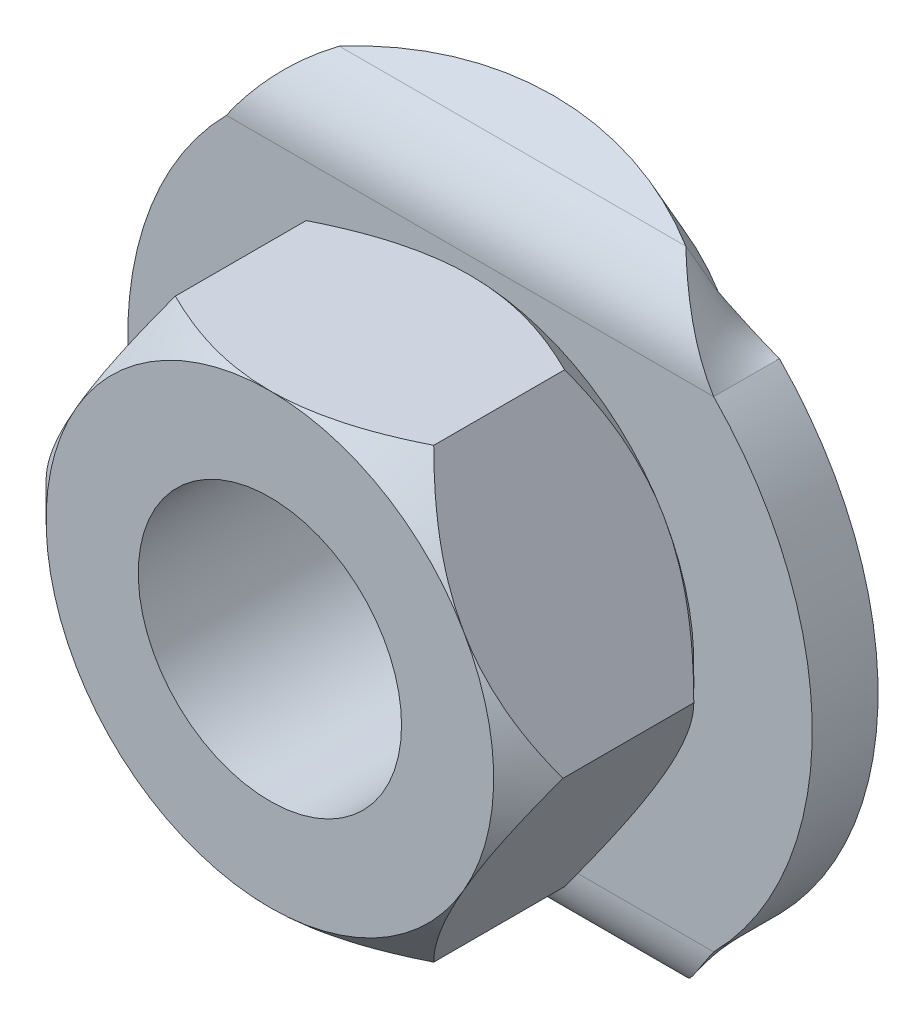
ISO-10303-21;
HEADER;
FILE_DESCRIPTION(('STEP AP214'),'2;1');
FILE_NAME('part.step','',(''),(''),'','','');
FILE_SCHEMA(('AUTOMOTIVE_DESIGN { 1 0 10303 214 1 1 1 1 }'));
ENDSEC;
DATA;
#1=APPLICATION_CONTEXT('core data for automotive mechanical design processes');
#2=APPLICATION_PROTOCOL_DEFINITION('international standard','automotive_design',2000,#1);
#3=PRODUCT_CONTEXT('',#1,'mechanical');
#4=PRODUCT('Part','Part','',(#3));
#5=PRODUCT_RELATED_PRODUCT_CATEGORY('part','',(#4));
#6=PRODUCT_DEFINITION_FORMATION('','',#4);
#7=PRODUCT_DEFINITION_CONTEXT('part definition',#1,'design');
#8=PRODUCT_DEFINITION('design','',#6,#7);
#9=PRODUCT_DEFINITION_SHAPE('','',#8);
#10=(LENGTH_UNIT() NAMED_UNIT(*) SI_UNIT(.MILLI.,.METRE.));
#11=(NAMED_UNIT(*) PLANE_ANGLE_UNIT() SI_UNIT($,.RADIAN.));
#12=(NAMED_UNIT(*) SI_UNIT($,.STERADIAN.) SOLID_ANGLE_UNIT());
#13=UNCERTAINTY_MEASURE_WITH_UNIT(LENGTH_MEASURE(1.E-05),#10,'distance_accuracy_value','');
#14=(GEOMETRIC_REPRESENTATION_CONTEXT(3) GLOBAL_UNCERTAINTY_ASSIGNED_CONTEXT((#13)) GLOBAL_UNIT_ASSIGNED_CONTEXT((#10,
#11,#12)) REPRESENTATION_CONTEXT('',''));
#15=CARTESIAN_POINT('',(0.,0.,0.));
#16=DIRECTION('',(0.,0.,1.));
#17=DIRECTION('',(1.,0.,0.));
#18=AXIS2_PLACEMENT_3D('',#15,#16,#17);
#19=CARTESIAN_POINT('',(0.,6.32847055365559,10.5913263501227));
#20=DIRECTION('',(0.,-0.86602540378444,-0.5));
#21=DIRECTION('',(0.,-0.5,0.86602540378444));
#22=AXIS2_PLACEMENT_3D('',#19,#20,#21);
#23=PLANE('',#22);
#24=CARTESIAN_POINT('',(0.,6.32847055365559,10.5913263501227));
#25=DIRECTION('',(0.,0.86602540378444,0.5));
#26=DIRECTION('',(0.,0.5,-0.86602540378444));
#27=AXIS2_PLACEMENT_3D('',#24,#25,#26);
#28=CIRCLE('',#27,13.);
#29=CARTESIAN_POINT('',(-6.58008674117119,11.9343259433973,0.881700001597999));
#30=VERTEX_POINT('',#29);
#31=CARTESIAN_POINT('',(6.58008674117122,11.9343259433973,0.881700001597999));
#32=VERTEX_POINT('',#31);
#33=EDGE_CURVE('E378',#30,#32,#28,.F.);
#34=ORIENTED_EDGE('',*,*,#33,.F.);
#35=DIRECTION('',(1.,0.,0.));
#36=VECTOR('',#35,1.);
#37=CARTESIAN_POINT('',(-18.7896736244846,11.9343259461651,0.881700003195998));
#38=LINE('',#37,#36);
#39=EDGE_CURVE('E384',#32,#30,#38,.F.);
#40=ORIENTED_EDGE('',*,*,#39,.F.);
#41=EDGE_LOOP('',(#34,#40));
#42=FACE_BOUND('',#41,.T.);
#43=ADVANCED_FACE('F14',(#42),#23,.F.);
#44=CARTESIAN_POINT('',(0.,-6.32847055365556,10.5913263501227));
#45=DIRECTION('',(0.,0.86602540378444,-0.5));
#46=DIRECTION('',(0.,-0.5,-0.86602540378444));
#47=AXIS2_PLACEMENT_3D('',#44,#45,#46);
#48=PLANE('',#47);
#49=CARTESIAN_POINT('',(0.,-6.32847055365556,10.5913263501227));
#50=DIRECTION('',(0.,-0.86602540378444,0.5));
#51=DIRECTION('',(0.,0.5,0.86602540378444));
#52=AXIS2_PLACEMENT_3D('',#49,#50,#51);
#53=CIRCLE('',#52,13.);
#54=CARTESIAN_POINT('',(6.58008674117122,-11.9343259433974,0.881700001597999));
#55=VERTEX_POINT('',#54);
#56=CARTESIAN_POINT('',(-6.58008674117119,-11.9343259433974,0.881700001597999));
#57=VERTEX_POINT('',#56);
#58=EDGE_CURVE('E381',#55,#57,#53,.F.);
#59=ORIENTED_EDGE('',*,*,#58,.F.);
#60=DIRECTION('',(-1.,0.,0.));
#61=VECTOR('',#60,1.);
#62=CARTESIAN_POINT('',(18.7896736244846,-11.934325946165,0.881700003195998));
#63=LINE('',#62,#61);
#64=EDGE_CURVE('E389',#57,#55,#63,.F.);
#65=ORIENTED_EDGE('',*,*,#64,.F.);
#66=EDGE_LOOP('',(#59,#65));
#67=FACE_BOUND('',#66,.T.);
#68=ADVANCED_FACE('F781',(#67),#48,.F.);
#69=CARTESIAN_POINT('',(0.,4.16340704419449,9.34132635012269));
#70=DIRECTION('',(0.,0.86602540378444,0.5));
#71=DIRECTION('',(0.,0.5,-0.86602540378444));
#72=AXIS2_PLACEMENT_3D('',#69,#70,#71);
#73=CYLINDRICAL_SURFACE('',#72,13.);
#74=DIRECTION('',(0.,0.86602540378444,0.5));
#75=VECTOR('',#74,1.);
#76=CARTESIAN_POINT('',(-6.58008674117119,10.8517941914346,0.256700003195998));
#77=LINE('',#76,#75);
#78=CARTESIAN_POINT('',(-6.58008674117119,9.76926243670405,-0.368299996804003));
#79=VERTEX_POINT('',#78);
#80=EDGE_CURVE('E575',#79,#30,#77,.T.);
#81=ORIENTED_EDGE('',*,*,#80,.T.);
#82=ORIENTED_EDGE('',*,*,#33,.T.);
#83=DIRECTION('',(0.,-0.866025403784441,-0.5));
#84=VECTOR('',#83,1.);
#85=CARTESIAN_POINT('',(6.58008674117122,10.8517941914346,0.256700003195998));
#86=LINE('',#85,#84);
#87=CARTESIAN_POINT('',(6.58008674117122,9.76926243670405,-0.368299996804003));
#88=VERTEX_POINT('',#87);
#89=EDGE_CURVE('E579',#32,#88,#86,.T.);
#90=ORIENTED_EDGE('',*,*,#89,.T.);
#91=CARTESIAN_POINT('',(0.,4.16340704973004,9.34132635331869));
#92=DIRECTION('',(0.,0.86602540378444,0.5));
#93=DIRECTION('',(0.,0.5,-0.86602540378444));
#94=AXIS2_PLACEMENT_3D('',#91,#92,#93);
#95=CIRCLE('',#94,13.);
#96=EDGE_CURVE('E399',#79,#88,#95,.F.);
#97=ORIENTED_EDGE('',*,*,#96,.F.);
#98=EDGE_LOOP('',(#81,#82,#90,#97));
#99=FACE_BOUND('',#98,.T.);
#100=ADVANCED_FACE('F660',(#99),#73,.T.);
#101=CARTESIAN_POINT('',(0.,-4.16340704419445,9.34132635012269));
#102=DIRECTION('',(0.,-0.86602540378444,0.5));
#103=DIRECTION('',(0.,0.5,0.86602540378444));
#104=AXIS2_PLACEMENT_3D('',#101,#102,#103);
#105=CYLINDRICAL_SURFACE('',#104,13.);
#106=DIRECTION('',(0.,-0.866025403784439,0.5));
#107=VECTOR('',#106,1.);
#108=CARTESIAN_POINT('',(6.58008674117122,-10.8517941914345,0.256700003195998));
#109=LINE('',#108,#107);
#110=CARTESIAN_POINT('',(6.58008674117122,-9.76926243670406,-0.368299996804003));
#111=VERTEX_POINT('',#110);
#112=EDGE_CURVE('E430',#111,#55,#109,.T.);
#113=ORIENTED_EDGE('',*,*,#112,.T.);
#114=ORIENTED_EDGE('',*,*,#58,.T.);
#115=DIRECTION('',(0.,0.866025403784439,-0.5));
#116=VECTOR('',#115,1.);
#117=CARTESIAN_POINT('',(-6.58008674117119,-10.8517941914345,0.256700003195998));
#118=LINE('',#117,#116);
#119=CARTESIAN_POINT('',(-6.58008674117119,-9.76926243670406,-0.368299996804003));
#120=VERTEX_POINT('',#119);
#121=EDGE_CURVE('E398',#57,#120,#118,.T.);
#122=ORIENTED_EDGE('',*,*,#121,.T.);
#123=CARTESIAN_POINT('',(0.,-4.16340704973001,9.34132635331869));
#124=DIRECTION('',(0.,-0.86602540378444,0.5));
#125=DIRECTION('',(0.,0.5,0.86602540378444));
#126=AXIS2_PLACEMENT_3D('',#123,#124,#125);
#127=CIRCLE('',#126,13.);
#128=EDGE_CURVE('E385',#111,#120,#127,.F.);
#129=ORIENTED_EDGE('',*,*,#128,.F.);
#130=EDGE_LOOP('',(#113,#114,#122,#129));
#131=FACE_BOUND('',#130,.T.);
#132=ADVANCED_FACE('F767',(#131),#105,.T.);
#133=CARTESIAN_POINT('',(-18.7896736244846,9.13134811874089,-0.7366));
#134=DIRECTION('',(1.,0.,0.));
#135=DIRECTION('',(0.,-1.,0.));
#136=AXIS2_PLACEMENT_3D('',#133,#134,#135);
#137=CYLINDRICAL_SURFACE('',#136,3.23660000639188);
#138=ORIENTED_EDGE('',*,*,#39,.T.);
#139=CARTESIAN_POINT('',(-6.58008674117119,11.9343259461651,0.881700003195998));
#140=CARTESIAN_POINT('',(-6.65230641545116,11.8970086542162,0.946375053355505));
#141=CARTESIAN_POINT('',(-6.72361693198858,11.8569800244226,1.01050073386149));
#142=CARTESIAN_POINT('',(-6.86472597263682,11.7716366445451,1.13696443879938));
#143=CARTESIAN_POINT('',(-6.93452365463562,11.7263190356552,1.19930147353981));
#144=CARTESIAN_POINT('',(-7.07284844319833,11.6305661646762,1.32143858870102));
#145=CARTESIAN_POINT('',(-7.14137530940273,11.5801299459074,1.38123819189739));
#146=CARTESIAN_POINT('',(-7.27751004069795,11.4741581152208,1.49791361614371));
#147=CARTESIAN_POINT('',(-7.3451139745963,11.4186056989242,1.55477877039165));
#148=CARTESIAN_POINT('',(-7.47921821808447,11.3027673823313,1.66483693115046));
#149=CARTESIAN_POINT('',(-7.54571876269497,11.2424825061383,1.71803072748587));
#150=CARTESIAN_POINT('',(-7.67761735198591,11.1174042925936,1.82029078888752));
#151=CARTESIAN_POINT('',(-7.74301553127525,11.0526115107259,1.86935756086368));
#152=CARTESIAN_POINT('',(-7.90405842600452,10.8863887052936,1.98554220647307));
#153=CARTESIAN_POINT('',(-7.99904768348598,10.7823845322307,2.04992502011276));
#154=CARTESIAN_POINT('',(-8.18720062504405,10.5664333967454,2.16705699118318));
#155=CARTESIAN_POINT('',(-8.28036388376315,10.4544846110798,2.2198034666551));
#156=CARTESIAN_POINT('',(-8.46455943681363,10.2244768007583,2.31232594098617));
#157=CARTESIAN_POINT('',(-8.55559871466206,10.1064437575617,2.35215252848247));
#158=CARTESIAN_POINT('',(-8.73599886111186,9.86547148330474,2.41811516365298));
#159=CARTESIAN_POINT('',(-8.82536079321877,9.74253552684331,2.44426018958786));
#160=CARTESIAN_POINT('',(-8.97109505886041,9.53792647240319,2.475385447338));
#161=CARTESIAN_POINT('',(-9.02787419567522,9.45716251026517,2.48458783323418));
#162=CARTESIAN_POINT('',(-9.14086878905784,9.29478485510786,2.49689664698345));
#163=CARTESIAN_POINT('',(-9.19708426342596,9.21317118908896,2.50000326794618));
#164=CARTESIAN_POINT('',(-9.25302553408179,9.13134811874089,2.5000000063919));
#165=B_SPLINE_CURVE_WITH_KNOTS('',3,(#139,#140,#141,#142,#143,#144,#145,#146,#147,#148,#149,
#150,#151,#152,#153,#154,#155,#156,#157,#158,#159,#160,#161,#162,#163,#164),.UNSPECIFIED.,.F.,
.F.,(4,2,2,2,2,2,2,2,2,2,2,2,4),(0.,0.311601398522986,0.623372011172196,0.935201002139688,
1.24809345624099,1.56091838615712,1.87370483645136,2.33764176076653,2.80168550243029,
3.26388968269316,3.72579016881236,4.02307155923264,4.32034353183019),.UNSPECIFIED.);
#166=CARTESIAN_POINT('',(-9.25302553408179,9.13134811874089,2.500000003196));
#167=VERTEX_POINT('',#166);
#168=EDGE_CURVE('E578',#30,#167,#165,.T.);
#169=ORIENTED_EDGE('',*,*,#168,.T.);
#170=DIRECTION('',(-1.,0.,0.));
#171=VECTOR('',#170,1.);
#172=CARTESIAN_POINT('',(0.,9.13134811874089,2.5));
#173=LINE('',#172,#171);
#174=CARTESIAN_POINT('',(9.2530255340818,9.13134811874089,2.500000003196));
#175=VERTEX_POINT('',#174);
#176=EDGE_CURVE('E429',#167,#175,#173,.F.);
#177=ORIENTED_EDGE('',*,*,#176,.T.);
#178=CARTESIAN_POINT('',(9.2530255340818,9.13134811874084,2.5000000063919));
#179=CARTESIAN_POINT('',(9.18402304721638,9.24018552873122,2.50000671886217));
#180=CARTESIAN_POINT('',(9.11355038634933,9.34804010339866,2.49451199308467));
#181=CARTESIAN_POINT('',(8.97003017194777,9.56086352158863,2.47315242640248));
#182=CARTESIAN_POINT('',(8.89698457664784,9.66583445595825,2.45729531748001));
#183=CARTESIAN_POINT('',(8.74893644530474,9.87163999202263,2.41594140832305));
#184=CARTESIAN_POINT('',(8.67394498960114,9.97249203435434,2.39049125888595));
#185=CARTESIAN_POINT('',(8.52196302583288,10.1699411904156,2.33057280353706));
#186=CARTESIAN_POINT('',(8.4449721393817,10.2665374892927,2.29610277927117));
#187=CARTESIAN_POINT('',(8.28795451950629,10.4565555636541,2.21808139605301));
#188=CARTESIAN_POINT('',(8.2078981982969,10.5498914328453,2.1743807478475));
#189=CARTESIAN_POINT('',(8.04643913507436,10.7310799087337,2.07887835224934));
#190=CARTESIAN_POINT('',(7.96503640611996,10.8189325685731,2.02707668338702));
#191=CARTESIAN_POINT('',(7.80078697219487,10.98866039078,1.91599746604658));
#192=CARTESIAN_POINT('',(7.71793821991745,11.0705260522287,1.85670842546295));
#193=CARTESIAN_POINT('',(7.55099500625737,11.2275788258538,1.7314940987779));
#194=CARTESIAN_POINT('',(7.46690068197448,11.3027666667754,1.6655695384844));
#195=CARTESIAN_POINT('',(7.25078036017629,11.4856044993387,1.48979096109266));
#196=CARTESIAN_POINT('',(7.11788988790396,11.5882974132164,1.37575604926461));
#197=CARTESIAN_POINT('',(6.91711105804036,11.7285193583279,1.19628330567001));
#198=CARTESIAN_POINT('',(6.85003823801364,11.7729050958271,1.13514621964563));
#199=CARTESIAN_POINT('',(6.7154101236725,11.8570788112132,1.01029184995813));
#200=CARTESIAN_POINT('',(6.64785483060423,11.8968668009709,0.946574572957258));
#201=CARTESIAN_POINT('',(6.58008674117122,11.9343259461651,0.881700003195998));
#202=B_SPLINE_CURVE_WITH_KNOTS('',3,(#178,#179,#180,#181,#182,#183,#184,#185,#186,#187,#188,
#189,#190,#191,#192,#193,#194,#195,#196,#197,#198,#199,#200,#201),.UNSPECIFIED.,.F.,.F.,(4,2,2,
2,2,2,2,2,2,2,2,4),(0.,0.386412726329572,0.772537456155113,1.15680819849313,1.54115220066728,
1.93226726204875,2.32337853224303,2.71509757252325,3.10677381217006,3.71439276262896,
4.01736338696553,4.32033322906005),.UNSPECIFIED.);
#203=EDGE_CURVE('E438',#175,#32,#202,.T.);
#204=ORIENTED_EDGE('',*,*,#203,.T.);
#205=EDGE_LOOP('',(#138,#169,#177,#204));
#206=FACE_BOUND('',#205,.T.);
#207=ADVANCED_FACE('F413',(#206),#137,.T.);
#208=CARTESIAN_POINT('',(18.7896736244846,-9.13134811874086,-0.736599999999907));
#209=DIRECTION('',(-1.,0.,0.));
#210=DIRECTION('',(0.,0.,1.));
#211=AXIS2_PLACEMENT_3D('',#208,#209,#210);
#212=CYLINDRICAL_SURFACE('',#211,3.23660000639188);
#213=ORIENTED_EDGE('',*,*,#64,.T.);
#214=CARTESIAN_POINT('',(6.58008674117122,-11.9343259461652,0.881700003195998));
#215=CARTESIAN_POINT('',(6.65230502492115,-11.8970093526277,0.946373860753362));
#216=CARTESIAN_POINT('',(6.72361395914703,-11.856981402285,1.0104985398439));
#217=CARTESIAN_POINT('',(6.864719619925,-11.7716394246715,1.13696047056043));
#218=CARTESIAN_POINT('',(6.93451550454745,-11.7263225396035,1.19929673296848));
#219=CARTESIAN_POINT('',(7.07283667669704,-11.6305712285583,1.32143240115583));
#220=CARTESIAN_POINT('',(7.14136172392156,-11.5801358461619,1.38123132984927));
#221=CARTESIAN_POINT('',(7.27749277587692,-11.47416590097,1.49790541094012));
#222=CARTESIAN_POINT('',(7.3450948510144,-11.4186145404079,1.55476990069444));
#223=CARTESIAN_POINT('',(7.4791954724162,-11.3027785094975,1.66482682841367));
#224=CARTESIAN_POINT('',(7.54569425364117,-11.2424948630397,1.7180200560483));
#225=CARTESIAN_POINT('',(7.67758940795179,-11.1174192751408,1.82027910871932));
#226=CARTESIAN_POINT('',(7.74298591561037,-11.0526278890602,1.86934544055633));
#227=CARTESIAN_POINT('',(7.90402557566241,-10.8864080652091,1.98552966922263));
#228=CARTESIAN_POINT('',(7.99901334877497,-10.7824055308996,2.04991250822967));
#229=CARTESIAN_POINT('',(8.18716380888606,-10.5664580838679,2.16704472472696));
#230=CARTESIAN_POINT('',(8.28032607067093,-10.4545113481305,2.21979142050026));
#231=CARTESIAN_POINT('',(8.46452014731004,-10.2245079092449,2.31231471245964));
#232=CARTESIAN_POINT('',(8.55555894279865,-10.1064771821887,2.35214188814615));
#233=CARTESIAN_POINT('',(8.73595862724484,-9.86550984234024,2.41810615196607));
#234=CARTESIAN_POINT('',(8.8253205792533,-9.74257650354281,2.44425221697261));
#235=CARTESIAN_POINT('',(8.97106170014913,-9.53796300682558,2.47538100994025));
#236=CARTESIAN_POINT('',(9.02784744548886,-9.45719177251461,2.48458505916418));
#237=CARTESIAN_POINT('',(9.14085534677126,-9.29479950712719,2.4968960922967));
#238=CARTESIAN_POINT('',(9.19707752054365,-9.21317850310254,2.50000326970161));
#239=CARTESIAN_POINT('',(9.2530255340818,-9.13134811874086,2.5000000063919));
#240=B_SPLINE_CURVE_WITH_KNOTS('',3,(#214,#215,#216,#217,#218,#219,#220,#221,#222,#223,#224,
#225,#226,#227,#228,#229,#230,#231,#232,#233,#234,#235,#236,#237,#238,#239),.UNSPECIFIED.,.F.,
.F.,(4,2,2,2,2,2,2,2,2,2,2,2,4),(0.,0.311595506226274,0.623360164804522,0.935183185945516,
1.24806926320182,1.5608878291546,1.8736679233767,2.33759887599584,2.80163663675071,
3.26383514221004,3.72572999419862,4.02304092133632,4.32034241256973),.UNSPECIFIED.);
#241=CARTESIAN_POINT('',(9.2530255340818,-9.13134811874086,2.500000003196));
#242=VERTEX_POINT('',#241);
#243=EDGE_CURVE('E420',#55,#242,#240,.T.);
#244=ORIENTED_EDGE('',*,*,#243,.T.);
#245=DIRECTION('',(-1.,0.,0.));
#246=VECTOR('',#245,1.);
#247=CARTESIAN_POINT('',(0.,-9.13134811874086,2.5));
#248=LINE('',#247,#246);
#249=CARTESIAN_POINT('',(-9.25302553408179,-9.13134811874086,2.500000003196));
#250=VERTEX_POINT('',#249);
#251=EDGE_CURVE('E570',#242,#250,#248,.T.);
#252=ORIENTED_EDGE('',*,*,#251,.T.);
#253=CARTESIAN_POINT('',(-9.25302553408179,-9.13134811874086,2.5000000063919));
#254=CARTESIAN_POINT('',(-9.18402121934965,-9.24018654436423,2.50000672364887));
#255=CARTESIAN_POINT('',(-9.11354691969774,-9.3480422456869,2.49451189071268));
#256=CARTESIAN_POINT('',(-8.97002369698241,-9.56086805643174,2.47315185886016));
#257=CARTESIAN_POINT('',(-8.89697673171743,-9.66584025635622,2.45729439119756));
#258=CARTESIAN_POINT('',(-8.7489260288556,-9.87164836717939,2.41593948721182));
#259=CARTESIAN_POINT('',(-8.67393337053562,-9.97250171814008,2.39048870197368));
#260=CARTESIAN_POINT('',(-8.52194909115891,-10.169953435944,2.33056870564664));
#261=CARTESIAN_POINT('',(-8.44495709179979,-10.2665509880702,2.29609777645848));
#262=CARTESIAN_POINT('',(-8.28793745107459,-10.4565712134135,2.21807442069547));
#263=CARTESIAN_POINT('',(-8.20788022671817,-10.5499079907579,2.1743727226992));
#264=CARTESIAN_POINT('',(-8.04641932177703,-10.7310981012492,2.07886806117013));
#265=CARTESIAN_POINT('',(-7.96501565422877,-10.8189514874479,2.02706517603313));
#266=CARTESIAN_POINT('',(-7.80076433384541,-10.9886805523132,1.91598339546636));
#267=CARTESIAN_POINT('',(-7.71791463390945,-11.0705467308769,1.85669300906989));
#268=CARTESIAN_POINT('',(-7.55096950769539,-11.22760033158,1.73147588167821));
#269=CARTESIAN_POINT('',(-7.4668742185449,-11.3027884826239,1.66554986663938));
#270=CARTESIAN_POINT('',(-7.25075739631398,-11.4856217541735,1.48977235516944));
#271=CARTESIAN_POINT('',(-7.1178715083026,-11.5883104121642,1.3757405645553));
#272=CARTESIAN_POINT('',(-6.91709958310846,-11.728526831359,1.1962731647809));
#273=CARTESIAN_POINT('',(-6.85002906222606,-11.7729108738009,1.13513796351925));
#274=CARTESIAN_POINT('',(-6.71540554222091,-11.8570814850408,1.01028757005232));
#275=CARTESIAN_POINT('',(-6.64785254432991,-11.8968680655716,0.946572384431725));
#276=CARTESIAN_POINT('',(-6.58008674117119,-11.934325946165,0.881700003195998));
#277=B_SPLINE_CURVE_WITH_KNOTS('',3,(#253,#254,#255,#256,#257,#258,#259,#260,#261,#262,#263,
#264,#265,#266,#267,#268,#269,#270,#271,#272,#273,#274,#275,#276),.UNSPECIFIED.,.F.,.F.,(4,2,2,
2,2,2,2,2,2,2,2,4),(0.,0.386418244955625,0.772548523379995,1.1568248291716,1.54117438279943,
1.93229409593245,2.32341002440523,2.71513365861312,3.10681448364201,3.71441285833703,
4.01737325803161,4.32033288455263),.UNSPECIFIED.);
#278=EDGE_CURVE('E388',#250,#57,#277,.T.);
#279=ORIENTED_EDGE('',*,*,#278,.T.);
#280=EDGE_LOOP('',(#213,#244,#252,#279));
#281=FACE_BOUND('',#280,.T.);
#282=ADVANCED_FACE('F407',(#281),#212,.T.);
#283=CARTESIAN_POINT('',(0.,-4.16340704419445,9.34132635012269));
#284=DIRECTION('',(0.,0.86602540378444,-0.5));
#285=DIRECTION('',(0.,-0.5,-0.86602540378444));
#286=AXIS2_PLACEMENT_3D('',#283,#284,#285);
#287=PLANE('',#286);
#288=ORIENTED_EDGE('',*,*,#128,.T.);
#289=DIRECTION('',(-1.,0.,0.));
#290=VECTOR('',#289,1.);
#291=CARTESIAN_POINT('',(18.7896736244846,-9.76926243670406,-0.368299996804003));
#292=LINE('',#291,#290);
#293=EDGE_CURVE('E469',#120,#111,#292,.F.);
#294=ORIENTED_EDGE('',*,*,#293,.T.);
#295=EDGE_LOOP('',(#288,#294));
#296=FACE_BOUND('',#295,.T.);
#297=ADVANCED_FACE('F412',(#296),#287,.T.);
#298=CARTESIAN_POINT('',(-6.58008674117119,-11.9561930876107,0.894325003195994));
#299=CARTESIAN_POINT('',(-7.1653039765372,-11.6302022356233,1.4589577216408));
#300=CARTESIAN_POINT('',(-7.6786565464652,-11.1589834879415,1.88112095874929));
#301=CARTESIAN_POINT('',(-8.56963614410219,-10.1523594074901,2.41321017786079));
#302=CARTESIAN_POINT('',(-8.9466446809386,-9.61831300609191,2.5252500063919));
#303=CARTESIAN_POINT('',(-9.25302553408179,-9.13134811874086,2.5252500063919));
#304=CARTESIAN_POINT('',(-6.58008674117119,-11.934325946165,0.881700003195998));
#305=CARTESIAN_POINT('',(-7.165292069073,-11.6108600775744,1.44195932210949));
#306=CARTESIAN_POINT('',(-7.6786565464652,-11.1432875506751,1.86085716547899));
#307=CARTESIAN_POINT('',(-8.56963614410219,-10.1444557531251,2.38882747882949));
#308=CARTESIAN_POINT('',(-8.9466386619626,-9.61454555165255,2.5000000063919));
#309=CARTESIAN_POINT('',(-9.25302553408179,-9.13134811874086,2.5000000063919));
#310=CARTESIAN_POINT('',(-6.58008674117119,-9.76926243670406,-0.368299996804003));
#311=CARTESIAN_POINT('',(-7.164113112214,-9.69579492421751,-0.241050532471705));
#312=CARTESIAN_POINT('',(-7.6786565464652,-9.58923435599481,-0.145458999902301));
#313=CARTESIAN_POINT('',(-8.56963614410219,-9.36191571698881,-0.0253011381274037));
#314=CARTESIAN_POINT('',(-8.9460427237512,-9.24153026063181,6.39190089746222E-09));
#315=CARTESIAN_POINT('',(-9.25302553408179,-9.13134811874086,6.39190089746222E-09));
#316=CARTESIAN_POINT('',(-6.58008674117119,-9.74761180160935,-0.380799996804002));
#317=CARTESIAN_POINT('',(-7.1641013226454,-9.67664427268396,-0.257880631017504));
#318=CARTESIAN_POINT('',(-7.6786565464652,-9.57369382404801,-0.165522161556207));
#319=CARTESIAN_POINT('',(-8.56963614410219,-9.35409031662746,-0.049442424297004));
#320=CARTESIAN_POINT('',(-8.9460367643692,-9.23780010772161,-0.0249999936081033));
#321=CARTESIAN_POINT('',(-9.25302553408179,-9.13134811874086,-0.0249999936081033));
#322=B_SPLINE_SURFACE_WITH_KNOTS('',1,3,((#298,#299,#300,#301,#302,#303),(#304,#305,#306,#307,
#308,#309),(#310,#311,#312,#313,#314,#315),(#316,#317,#318,#319,#320,#321)),.UNSPECIFIED.,.F.,
.F.,.F.,(2,1,1,2),(4,2,4),(-0.0101,0.,1.,1.01),(0.,0.5,1.),.UNSPECIFIED.);
#323=DIRECTION('',(0.,0.,1.));
#324=VECTOR('',#323,1.);
#325=CARTESIAN_POINT('',(-9.25302553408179,-9.13134811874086,0.));
#326=LINE('',#325,#324);
#327=CARTESIAN_POINT('',(-9.25302553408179,-9.13134811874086,3.19599902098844E-09));
#328=VERTEX_POINT('',#327);
#329=EDGE_CURVE('E468',#328,#250,#326,.T.);
#330=CARTESIAN_POINT('',(-9.25302553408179,-9.13134811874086,6.39190089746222E-09));
#331=CARTESIAN_POINT('',(-9.1950853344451,-9.15214331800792,-5.8352059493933E-06));
#332=CARTESIAN_POINT('',(-9.13698646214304,-9.17247298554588,-0.000879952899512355));
#333=CARTESIAN_POINT('',(-9.02052695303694,-9.21220758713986,-0.00417901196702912));
#334=CARTESIAN_POINT('',(-8.96216636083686,-9.23161267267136,-0.00660369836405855));
#335=CARTESIAN_POINT('',(-8.78687068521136,-9.28842038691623,-0.0159189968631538));
#336=CARTESIAN_POINT('',(-8.66959865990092,-9.32445952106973,-0.0248516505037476));
#337=CARTESIAN_POINT('',(-8.43454435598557,-9.39298547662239,-0.0470911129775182));
#338=CARTESIAN_POINT('',(-8.31676249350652,-9.42547477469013,-0.0603948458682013));
#339=CARTESIAN_POINT('',(-8.08074090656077,-9.48715124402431,-0.0907198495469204));
#340=CARTESIAN_POINT('',(-7.96250095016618,-9.51633642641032,-0.107743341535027));
#341=CARTESIAN_POINT('',(-7.73912928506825,-9.56812627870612,-0.142741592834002));
#342=CARTESIAN_POINT('',(-7.63403160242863,-9.59110187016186,-0.160389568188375));
#343=CARTESIAN_POINT('',(-7.42359877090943,-9.63425758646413,-0.197643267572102));
#344=CARTESIAN_POINT('',(-7.3182635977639,-9.65443741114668,-0.217249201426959));
#345=CARTESIAN_POINT('',(-7.10752530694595,-9.69198533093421,-0.258025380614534));
#346=CARTESIAN_POINT('',(-7.00212240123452,-9.70935658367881,-0.279193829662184));
#347=CARTESIAN_POINT('',(-6.79119259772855,-9.74135504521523,-0.322835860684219));
#348=CARTESIAN_POINT('',(-6.68566572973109,-9.75598281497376,-0.345309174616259));
#349=CARTESIAN_POINT('',(-6.58008674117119,-9.76926243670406,-0.368299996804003));
#350=B_SPLINE_CURVE_WITH_KNOTS('',3,(#330,#331,#332,#333,#334,#335,#336,#337,#338,#339,#340,
#341,#342,#343,#344,#345,#346,#347,#348,#349),.UNSPECIFIED.,.F.,.F.,(4,2,2,2,2,2,2,2,2,4),(0.,
0.184656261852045,0.36928216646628,0.738142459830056,1.10674373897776,1.47556572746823,
1.80256363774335,2.12959662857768,2.45625934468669,2.78285519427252),.UNSPECIFIED.);
#351=EDGE_CURVE('E431',#328,#120,#350,.T.);
#352=ORIENTED_EDGE('',*,*,#278,.F.);
#353=ORIENTED_EDGE('',*,*,#329,.F.);
#354=ORIENTED_EDGE('',*,*,#351,.T.);
#355=ORIENTED_EDGE('',*,*,#121,.F.);
#356=EDGE_LOOP('',(#352,#353,#354,#355));
#357=FACE_BOUND('',#356,.T.);
#358=ADVANCED_FACE('F401',(#357),#322,.F.);
#359=CARTESIAN_POINT('',(0.,4.16340704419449,9.34132635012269));
#360=DIRECTION('',(0.,-0.86602540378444,-0.5));
#361=DIRECTION('',(0.,-0.5,0.86602540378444));
#362=AXIS2_PLACEMENT_3D('',#359,#360,#361);
#363=PLANE('',#362);
#364=ORIENTED_EDGE('',*,*,#96,.T.);
#365=DIRECTION('',(1.,0.,0.));
#366=VECTOR('',#365,1.);
#367=CARTESIAN_POINT('',(-18.7896736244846,9.76926243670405,-0.368299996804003));
#368=LINE('',#367,#366);
#369=EDGE_CURVE('E547',#88,#79,#368,.F.);
#370=ORIENTED_EDGE('',*,*,#369,.T.);
#371=EDGE_LOOP('',(#364,#370));
#372=FACE_BOUND('',#371,.T.);
#373=ADVANCED_FACE('F482',(#372),#363,.T.);
#374=CARTESIAN_POINT('',(-9.25302553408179,9.13134811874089,2.5252500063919));
#375=CARTESIAN_POINT('',(-9.00934291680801,9.49057189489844,2.5252500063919));
#376=CARTESIAN_POINT('',(-8.77118350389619,9.82977183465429,2.4658108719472));
#377=CARTESIAN_POINT('',(-8.3049210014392,10.442118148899,2.26758258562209));
#378=CARTESIAN_POINT('',(-8.07698292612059,10.7152172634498,2.12906740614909));
#379=CARTESIAN_POINT('',(-7.408748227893,11.4238650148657,1.65257025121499));
#380=CARTESIAN_POINT('',(-6.98261233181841,11.7466085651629,1.25733604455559));
#381=CARTESIAN_POINT('',(-6.58008674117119,11.9561930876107,0.894325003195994));
#382=CARTESIAN_POINT('',(-9.25302553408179,9.13134811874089,2.5000000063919));
#383=CARTESIAN_POINT('',(-9.00934432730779,9.48779067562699,2.5000000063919));
#384=CARTESIAN_POINT('',(-8.77118350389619,9.82436533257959,2.44102099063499));
#385=CARTESIAN_POINT('',(-8.3049210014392,10.4319714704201,2.2443271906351));
#386=CARTESIAN_POINT('',(-8.07698292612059,10.7029565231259,2.10688425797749));
#387=CARTESIAN_POINT('',(-7.408748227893,11.4061186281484,1.63407567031));
#388=CARTESIAN_POINT('',(-6.98262509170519,11.7263623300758,1.24190355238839));
#389=CARTESIAN_POINT('',(-6.58008674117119,11.9343259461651,0.881700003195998));
#390=CARTESIAN_POINT('',(-9.25302553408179,9.13134811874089,6.39190089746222E-09));
#391=CARTESIAN_POINT('',(-9.00948398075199,9.21242243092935,6.39190089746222E-09));
#392=CARTESIAN_POINT('',(-8.77118350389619,9.28906809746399,-0.0134227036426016));
#393=CARTESIAN_POINT('',(-8.3049210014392,9.42734983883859,-0.0581871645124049));
#394=CARTESIAN_POINT('',(-8.07698292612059,9.48902183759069,-0.0894670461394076));
#395=CARTESIAN_POINT('',(-7.408748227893,9.6490506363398,-0.197070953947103));
#396=CARTESIAN_POINT('',(-6.98388844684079,9.72178459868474,-0.286065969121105));
#397=CARTESIAN_POINT('',(-6.58008674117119,9.76926243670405,-0.368299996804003));
#398=CARTESIAN_POINT('',(-9.25302553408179,9.13134811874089,-0.0249999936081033));
#399=CARTESIAN_POINT('',(-9.00948537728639,9.20966874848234,-0.0249999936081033));
#400=CARTESIAN_POINT('',(-8.77118350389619,9.28371512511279,-0.0379671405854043));
#401=CARTESIAN_POINT('',(-8.3049210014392,9.4173036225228,-0.0812123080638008));
#402=CARTESIAN_POINT('',(-8.07698292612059,9.47688249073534,-0.111430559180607));
#403=CARTESIAN_POINT('',(-7.408748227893,9.63147995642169,-0.215382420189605));
#404=CARTESIAN_POINT('',(-6.98390108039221,9.70173882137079,-0.301345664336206));
#405=CARTESIAN_POINT('',(-6.58008674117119,9.74761180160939,-0.380799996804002));
#406=B_SPLINE_SURFACE_WITH_KNOTS('',1,3,((#374,#375,#376,#377,#378,#379,#380,#381),(#382,#383,
#384,#385,#386,#387,#388,#389),(#390,#391,#392,#393,#394,#395,#396,#397),(#398,#399,#400,#401,
#402,#403,#404,#405)),.UNSPECIFIED.,.F.,.F.,.F.,(2,1,1,2),(4,2,2,4),(-0.0101,0.,1.,1.01),(0.,
0.25,0.5,1.),.UNSPECIFIED.);
#407=CARTESIAN_POINT('',(-6.58008674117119,9.76926243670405,-0.368299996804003));
#408=CARTESIAN_POINT('',(-6.69965351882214,9.75521627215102,-0.343905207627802));
#409=CARTESIAN_POINT('',(-6.81897461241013,9.73918432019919,-0.319428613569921));
#410=CARTESIAN_POINT('',(-7.05721007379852,9.70314072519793,-0.271278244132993));
#411=CARTESIAN_POINT('',(-7.17612432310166,9.68312800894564,-0.247604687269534));
#412=CARTESIAN_POINT('',(-7.41358868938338,9.63911818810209,-0.202036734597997));
#413=CARTESIAN_POINT('',(-7.53213873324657,9.61512033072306,-0.180142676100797));
#414=CARTESIAN_POINT('',(-7.70962501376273,9.57614238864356,-0.149222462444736));
#415=CARTESIAN_POINT('',(-7.76872521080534,9.56265426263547,-0.139236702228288));
#416=CARTESIAN_POINT('',(-7.88681401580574,9.53468383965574,-0.120006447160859));
#417=CARTESIAN_POINT('',(-7.94580261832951,9.52020149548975,-0.110761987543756));
#418=CARTESIAN_POINT('',(-8.10924004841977,9.47878650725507,-0.0863611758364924));
#419=CARTESIAN_POINT('',(-8.21358864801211,9.45088200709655,-0.0721575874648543));
#420=CARTESIAN_POINT('',(-8.42198999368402,9.39255369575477,-0.0471369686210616));
#421=CARTESIAN_POINT('',(-8.52604273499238,9.36212984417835,-0.0363199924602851));
#422=CARTESIAN_POINT('',(-8.73406309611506,9.29911710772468,-0.0186150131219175));
#423=CARTESIAN_POINT('',(-8.83803011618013,9.26652396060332,-0.0117350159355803));
#424=CARTESIAN_POINT('',(-9.04571414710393,9.19987162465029,-0.00241568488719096));
#425=CARTESIAN_POINT('',(-9.14943110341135,9.16581214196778,2.27546150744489E-05));
#426=CARTESIAN_POINT('',(-9.25302553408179,9.13134811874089,6.39190089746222E-09));
#427=B_SPLINE_CURVE_WITH_KNOTS('',3,(#407,#408,#409,#410,#411,#412,#413,#414,#415,#416,#417,
#418,#419,#420,#421,#422,#423,#424,#425,#426),.UNSPECIFIED.,.F.,.F.,(4,2,2,2,2,2,2,2,2,4),(0.,
0.368497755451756,0.737094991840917,1.10576193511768,1.29006143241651,1.47436968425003,
1.80112234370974,2.12788024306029,2.45530027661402,2.78278623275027),.UNSPECIFIED.);
#428=CARTESIAN_POINT('',(-9.25302553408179,9.13134811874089,3.19599902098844E-09));
#429=VERTEX_POINT('',#428);
#430=EDGE_CURVE('E535',#79,#429,#427,.T.);
#431=DIRECTION('',(0.,0.,1.));
#432=VECTOR('',#431,1.);
#433=CARTESIAN_POINT('',(-9.25302553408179,9.13134811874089,0.));
#434=LINE('',#433,#432);
#435=EDGE_CURVE('E548',#167,#429,#434,.F.);
#436=ORIENTED_EDGE('',*,*,#80,.F.);
#437=ORIENTED_EDGE('',*,*,#430,.T.);
#438=ORIENTED_EDGE('',*,*,#435,.F.);
#439=ORIENTED_EDGE('',*,*,#168,.F.);
#440=EDGE_LOOP('',(#436,#437,#438,#439));
#441=FACE_BOUND('',#440,.T.);
#442=ADVANCED_FACE('F484',(#441),#406,.F.);
#443=CARTESIAN_POINT('',(6.58008674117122,11.9561930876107,0.894325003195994));
#444=CARTESIAN_POINT('',(7.16532197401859,11.6301922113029,1.45897508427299));
#445=CARTESIAN_POINT('',(7.67868307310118,11.158959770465,1.88113932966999));
#446=CARTESIAN_POINT('',(8.569662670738,10.1523308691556,2.4132194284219));
#447=CARTESIAN_POINT('',(8.94666254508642,9.61829300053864,2.5252500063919));
#448=CARTESIAN_POINT('',(9.2530255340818,9.13134811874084,2.5252500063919));
#449=CARTESIAN_POINT('',(6.58008674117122,11.9343259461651,0.881700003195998));
#450=CARTESIAN_POINT('',(7.16531006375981,11.6108501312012,1.4419765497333));
#451=CARTESIAN_POINT('',(7.67868307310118,11.1432640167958,1.8608753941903));
#452=CARTESIAN_POINT('',(8.569662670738,10.144427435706,2.388836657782));
#453=CARTESIAN_POINT('',(8.94665652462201,9.61452570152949,2.5000000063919));
#454=CARTESIAN_POINT('',(9.2530255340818,9.13134811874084,2.5000000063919));
#455=CARTESIAN_POINT('',(6.58008674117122,9.76926243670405,-0.368299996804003));
#456=CARTESIAN_POINT('',(7.1641308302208,9.69579269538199,-0.241046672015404));
#457=CARTESIAN_POINT('',(7.67868307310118,9.58922900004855,-0.1454548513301));
#458=CARTESIAN_POINT('',(8.569662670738,9.36190927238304,-0.0252990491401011));
#459=CARTESIAN_POINT('',(8.94606043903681,9.24152579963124,6.39190089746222E-09));
#460=CARTESIAN_POINT('',(9.2530255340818,9.13134811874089,6.39190089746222E-09));
#461=CARTESIAN_POINT('',(6.58008674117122,9.74761180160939,-0.380799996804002));
#462=CARTESIAN_POINT('',(7.16411903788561,9.67664212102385,-0.257876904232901));
#463=CARTESIAN_POINT('',(7.67868307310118,9.57368864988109,-0.1655181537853));
#464=CARTESIAN_POINT('',(8.569662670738,9.35408409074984,-0.0494404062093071));
#465=CARTESIAN_POINT('',(8.946054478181,9.23779580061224,-0.0249999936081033));
#466=CARTESIAN_POINT('',(9.2530255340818,9.13134811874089,-0.0249999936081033));
#467=B_SPLINE_SURFACE_WITH_KNOTS('',1,3,((#443,#444,#445,#446,#447,#448),(#449,#450,#451,#452,
#453,#454),(#455,#456,#457,#458,#459,#460),(#461,#462,#463,#464,#465,#466)),.UNSPECIFIED.,.F.,
.F.,.F.,(2,1,1,2),(4,2,4),(-0.0101,0.,1.,1.01),(0.,0.5,1.),.UNSPECIFIED.);
#468=DIRECTION('',(0.,0.,1.));
#469=VECTOR('',#468,1.);
#470=CARTESIAN_POINT('',(9.2530255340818,9.13134811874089,0.));
#471=LINE('',#470,#469);
#472=CARTESIAN_POINT('',(9.2530255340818,9.13134811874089,3.19599902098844E-09));
#473=VERTEX_POINT('',#472);
#474=EDGE_CURVE('E602',#473,#175,#471,.T.);
#475=CARTESIAN_POINT('',(9.2530255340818,9.13134811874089,6.39190089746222E-09));
#476=CARTESIAN_POINT('',(9.19508543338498,9.1521436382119,-5.83785129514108E-06));
#477=CARTESIAN_POINT('',(9.13698662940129,9.17247354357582,-0.000879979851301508));
#478=CARTESIAN_POINT('',(9.02052721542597,9.21220849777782,-0.00417910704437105));
#479=CARTESIAN_POINT('',(8.96216665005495,9.23161369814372,-0.00660383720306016));
#480=CARTESIAN_POINT('',(8.78687102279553,9.28842163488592,-0.0159192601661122));
#481=CARTESIAN_POINT('',(8.6695989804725,9.32446075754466,-0.024851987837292));
#482=CARTESIAN_POINT('',(8.43454463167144,9.39298658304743,-0.0470915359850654));
#483=CARTESIAN_POINT('',(8.3167627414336,9.42547576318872,-0.0603952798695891));
#484=CARTESIAN_POINT('',(8.08074109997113,9.48715201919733,-0.0907202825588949));
#485=CARTESIAN_POINT('',(7.96250111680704,9.51633710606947,-0.107743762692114));
#486=CARTESIAN_POINT('',(7.73912939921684,9.56812678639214,-0.142741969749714));
#487=CARTESIAN_POINT('',(7.63403169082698,9.5911023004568,-0.160389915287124));
#488=CARTESIAN_POINT('',(7.4235988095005,9.63425787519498,-0.197643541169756));
#489=CARTESIAN_POINT('',(7.31826361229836,9.65443763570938,-0.217249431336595));
#490=CARTESIAN_POINT('',(7.10752529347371,9.69198544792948,-0.258025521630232));
#491=CARTESIAN_POINT('',(7.00212238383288,9.70935665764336,-0.27919392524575));
#492=CARTESIAN_POINT('',(6.79119258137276,9.74135506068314,-0.322835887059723));
#493=CARTESIAN_POINT('',(6.6856657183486,9.75598281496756,-0.345309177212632));
#494=CARTESIAN_POINT('',(6.58008674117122,9.76926243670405,-0.368299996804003));
#495=B_SPLINE_CURVE_WITH_KNOTS('',3,(#475,#476,#477,#478,#479,#480,#481,#482,#483,#484,#485,
#486,#487,#488,#489,#490,#491,#492,#493,#494),.UNSPECIFIED.,.F.,.F.,(4,2,2,2,2,2,2,2,2,4),(0.,
0.184656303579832,0.369282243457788,0.738142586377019,1.10674385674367,1.47556585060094,
1.80256377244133,2.1295967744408,2.4562594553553,2.7828552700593),.UNSPECIFIED.);
#496=EDGE_CURVE('E541',#473,#88,#495,.T.);
#497=ORIENTED_EDGE('',*,*,#203,.F.);
#498=ORIENTED_EDGE('',*,*,#474,.F.);
#499=ORIENTED_EDGE('',*,*,#496,.T.);
#500=ORIENTED_EDGE('',*,*,#89,.F.);
#501=EDGE_LOOP('',(#497,#498,#499,#500));
#502=FACE_BOUND('',#501,.T.);
#503=ADVANCED_FACE('F449',(#502),#467,.F.);
#504=CARTESIAN_POINT('',(9.2530255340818,-9.13134811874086,2.5252500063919));
#505=CARTESIAN_POINT('',(9.00931703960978,-9.4905988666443,2.5252500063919));
#506=CARTESIAN_POINT('',(8.7711383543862,-9.82981840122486,2.4658020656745));
#507=CARTESIAN_POINT('',(8.3048500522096,-10.4421866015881,2.26755415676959));
#508=CARTESIAN_POINT('',(8.0769055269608,-10.715288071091,2.1290282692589));
#509=CARTESIAN_POINT('',(7.4086708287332,-11.4239240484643,1.6525136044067));
#510=CARTESIAN_POINT('',(6.98256028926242,-11.7466356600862,1.25728911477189));
#511=CARTESIAN_POINT('',(6.58008674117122,-11.9561930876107,0.894325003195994));
#512=CARTESIAN_POINT('',(9.2530255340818,-9.13134811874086,2.5000000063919));
#513=CARTESIAN_POINT('',(9.0093184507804,-9.48781743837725,2.5000000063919));
#514=CARTESIAN_POINT('',(8.7711383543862,-9.82441153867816,2.44101225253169));
#515=CARTESIAN_POINT('',(8.3048500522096,-10.4320393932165,2.2442989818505));
#516=CARTESIAN_POINT('',(8.0769055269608,-10.7030267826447,2.10684542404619));
#517=CARTESIAN_POINT('',(7.4086708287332,-11.4061772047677,1.63401946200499));
#518=CARTESIAN_POINT('',(6.98257305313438,-11.7263892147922,1.2418569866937));
#519=CARTESIAN_POINT('',(6.58008674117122,-11.9343259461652,0.881700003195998));
#520=CARTESIAN_POINT('',(9.2530255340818,-9.13134811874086,6.39190089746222E-09));
#521=CARTESIAN_POINT('',(9.00945817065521,-9.2124285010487,6.39190089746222E-09));
#522=CARTESIAN_POINT('',(8.7711383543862,-9.28907861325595,-0.0134246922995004));
#523=CARTESIAN_POINT('',(8.3048500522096,-9.42736529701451,-0.0581935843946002));
#524=CARTESIAN_POINT('',(8.0769055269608,-9.48903782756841,-0.0894758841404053));
#525=CARTESIAN_POINT('',(7.4086708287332,-9.64906396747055,-0.197083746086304));
#526=CARTESIAN_POINT('',(6.98383680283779,-9.72179067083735,-0.286076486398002));
#527=CARTESIAN_POINT('',(6.58008674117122,-9.76926243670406,-0.368299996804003));
#528=CARTESIAN_POINT('',(9.2530255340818,-9.13134811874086,-0.0249999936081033));
#529=CARTESIAN_POINT('',(9.00945956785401,-9.20967461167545,-0.0249999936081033));
#530=CARTESIAN_POINT('',(8.7711383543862,-9.28372528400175,-0.0379690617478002));
#531=CARTESIAN_POINT('',(8.3048500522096,-9.4173185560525,-0.0812185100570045));
#532=CARTESIAN_POINT('',(8.0769055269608,-9.47689793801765,-0.111439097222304));
#533=CARTESIAN_POINT('',(7.4086708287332,-9.63149283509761,-0.215394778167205));
#534=CARTESIAN_POINT('',(6.98384944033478,-9.70174468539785,-0.301355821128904));
#535=CARTESIAN_POINT('',(6.58008674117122,-9.74761180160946,-0.380799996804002));
#536=B_SPLINE_SURFACE_WITH_KNOTS('',1,3,((#504,#505,#506,#507,#508,#509,#510,#511),(#512,#513,
#514,#515,#516,#517,#518,#519),(#520,#521,#522,#523,#524,#525,#526,#527),(#528,#529,#530,#531,
#532,#533,#534,#535)),.UNSPECIFIED.,.F.,.F.,.F.,(2,1,1,2),(4,2,2,4),(-0.0101,0.,1.,1.01),(0.,
0.25,0.5,1.),.UNSPECIFIED.);
#537=CARTESIAN_POINT('',(6.58008674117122,-9.76926243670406,-0.368299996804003));
#538=CARTESIAN_POINT('',(6.69965352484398,-9.75521626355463,-0.343905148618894));
#539=CARTESIAN_POINT('',(6.81897456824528,-9.73918415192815,-0.319428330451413));
#540=CARTESIAN_POINT('',(7.05720986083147,-9.70314006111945,-0.271277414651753));
#541=CARTESIAN_POINT('',(7.17612399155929,-9.68312700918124,-0.247603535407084));
#542=CARTESIAN_POINT('',(7.41358812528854,-9.63911646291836,-0.202035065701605));
#543=CARTESIAN_POINT('',(7.53213805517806,-9.61511821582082,-0.180140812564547));
#544=CARTESIAN_POINT('',(7.70962417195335,-9.57613966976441,-0.149220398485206));
#545=CARTESIAN_POINT('',(7.76872431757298,-9.56265133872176,-0.139234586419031));
#546=CARTESIAN_POINT('',(7.88681303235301,-9.53468053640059,-0.120004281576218));
#547=CARTESIAN_POINT('',(7.9458015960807,-9.52019801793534,-0.110759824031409));
#548=CARTESIAN_POINT('',(8.10923892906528,-9.47878263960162,-0.0863591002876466));
#549=CARTESIAN_POINT('',(8.21358749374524,-9.45087799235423,-0.0721556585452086));
#550=CARTESIAN_POINT('',(8.42198884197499,-9.39254962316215,-0.0471354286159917));
#551=CARTESIAN_POINT('',(8.52604162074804,-9.36212586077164,-0.0363186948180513));
#552=CARTESIAN_POINT('',(8.73406213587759,-9.29911364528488,-0.0186142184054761));
#553=CARTESIAN_POINT('',(8.83802927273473,-9.26652093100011,-0.0117344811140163));
#554=CARTESIAN_POINT('',(9.04571364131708,-9.19986982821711,-0.00241554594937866));
#555=CARTESIAN_POINT('',(9.14943081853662,-9.16581114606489,2.27579648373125E-05));
#556=CARTESIAN_POINT('',(9.2530255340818,-9.13134811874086,6.39190089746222E-09));
#557=B_SPLINE_CURVE_WITH_KNOTS('',3,(#537,#538,#539,#540,#541,#542,#543,#544,#545,#546,#547,
#548,#549,#550,#551,#552,#553,#554,#555,#556),.UNSPECIFIED.,.F.,.F.,(4,2,2,2,2,2,2,2,2,4),(0.,
0.368497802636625,0.737095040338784,1.10576198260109,1.29006149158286,1.47436975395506,
1.80112237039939,2.12788023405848,2.45530017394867,2.78278600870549),.UNSPECIFIED.);
#558=CARTESIAN_POINT('',(9.2530255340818,-9.13134811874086,3.19599902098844E-09));
#559=VERTEX_POINT('',#558);
#560=EDGE_CURVE('E461',#111,#559,#557,.T.);
#561=DIRECTION('',(0.,0.,1.));
#562=VECTOR('',#561,1.);
#563=CARTESIAN_POINT('',(9.2530255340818,-9.13134811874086,0.));
#564=LINE('',#563,#562);
#565=EDGE_CURVE('E601',#242,#559,#564,.F.);
#566=ORIENTED_EDGE('',*,*,#112,.F.);
#567=ORIENTED_EDGE('',*,*,#560,.T.);
#568=ORIENTED_EDGE('',*,*,#565,.F.);
#569=ORIENTED_EDGE('',*,*,#243,.F.);
#570=EDGE_LOOP('',(#566,#567,#568,#569));
#571=FACE_BOUND('',#570,.T.);
#572=ADVANCED_FACE('F444',(#571),#536,.F.);
#573=CARTESIAN_POINT('',(0.,0.,2.5));
#574=DIRECTION('',(0.,0.,-1.));
#575=DIRECTION('',(-1.,0.,0.));
#576=AXIS2_PLACEMENT_3D('',#573,#574,#575);
#577=PLANE('',#576);
#578=CARTESIAN_POINT('',(0.,0.,2.5));
#579=DIRECTION('',(0.,0.,-1.));
#580=DIRECTION('',(0.,1.,0.));
#581=AXIS2_PLACEMENT_3D('',#578,#579,#580);
#582=CIRCLE('',#581,8.5);
#583=CARTESIAN_POINT('',(7.36121593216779,-4.24999999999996,2.5));
#584=VERTEX_POINT('',#583);
#585=CARTESIAN_POINT('',(0.,-8.5,2.5));
#586=VERTEX_POINT('',#585);
#587=EDGE_CURVE('E374',#584,#586,#582,.T.);
#588=ORIENTED_EDGE('',*,*,#587,.T.);
#589=CARTESIAN_POINT('',(0.,0.,2.5));
#590=DIRECTION('',(0.,0.,-1.));
#591=DIRECTION('',(0.,1.,0.));
#592=AXIS2_PLACEMENT_3D('',#589,#590,#591);
#593=CIRCLE('',#592,8.5);
#594=CARTESIAN_POINT('',(-7.36121593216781,-4.24999999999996,2.5));
#595=VERTEX_POINT('',#594);
#596=EDGE_CURVE('E9',#586,#595,#593,.T.);
#597=ORIENTED_EDGE('',*,*,#596,.T.);
#598=CARTESIAN_POINT('',(0.,0.,2.5));
#599=DIRECTION('',(0.,0.,-1.));
#600=DIRECTION('',(0.,1.,0.));
#601=AXIS2_PLACEMENT_3D('',#598,#599,#600);
#602=CIRCLE('',#601,8.5);
#603=CARTESIAN_POINT('',(-7.36121593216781,4.25,2.5));
#604=VERTEX_POINT('',#603);
#605=EDGE_CURVE('E25',#595,#604,#602,.T.);
#606=ORIENTED_EDGE('',*,*,#605,.T.);
#607=CARTESIAN_POINT('',(0.,0.,2.5));
#608=DIRECTION('',(0.,0.,-1.));
#609=DIRECTION('',(0.,1.,0.));
#610=AXIS2_PLACEMENT_3D('',#607,#608,#609);
#611=CIRCLE('',#610,8.5);
#612=CARTESIAN_POINT('',(0.,8.5,2.5));
#613=VERTEX_POINT('',#612);
#614=EDGE_CURVE('E335',#604,#613,#611,.T.);
#615=ORIENTED_EDGE('',*,*,#614,.T.);
#616=CARTESIAN_POINT('',(0.,0.,2.5));
#617=DIRECTION('',(0.,0.,-1.));
#618=DIRECTION('',(0.,1.,0.));
#619=AXIS2_PLACEMENT_3D('',#616,#617,#618);
#620=CIRCLE('',#619,8.5);
#621=CARTESIAN_POINT('',(7.36121593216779,4.25,2.5));
#622=VERTEX_POINT('',#621);
#623=EDGE_CURVE('E339',#613,#622,#620,.T.);
#624=ORIENTED_EDGE('',*,*,#623,.T.);
#625=CARTESIAN_POINT('',(0.,0.,2.5));
#626=DIRECTION('',(0.,0.,-1.));
#627=DIRECTION('',(0.,1.,0.));
#628=AXIS2_PLACEMENT_3D('',#625,#626,#627);
#629=CIRCLE('',#628,8.5);
#630=EDGE_CURVE('E342',#622,#584,#629,.T.);
#631=ORIENTED_EDGE('',*,*,#630,.T.);
#632=EDGE_LOOP('',(#588,#597,#606,#615,#624,#631));
#633=FACE_BOUND('',#632,.T.);
#634=ORIENTED_EDGE('',*,*,#251,.F.);
#635=CARTESIAN_POINT('',(0.,0.,2.5));
#636=DIRECTION('',(0.,0.,1.));
#637=DIRECTION('',(1.,0.,0.));
#638=AXIS2_PLACEMENT_3D('',#635,#636,#637);
#639=CIRCLE('',#638,13.);
#640=EDGE_CURVE('E599',#175,#242,#639,.F.);
#641=ORIENTED_EDGE('',*,*,#640,.F.);
#642=ORIENTED_EDGE('',*,*,#176,.F.);
#643=CARTESIAN_POINT('',(0.,0.,2.5));
#644=DIRECTION('',(0.,0.,1.));
#645=DIRECTION('',(1.,0.,0.));
#646=AXIS2_PLACEMENT_3D('',#643,#644,#645);
#647=CIRCLE('',#646,13.);
#648=EDGE_CURVE('E470',#250,#167,#647,.F.);
#649=ORIENTED_EDGE('',*,*,#648,.F.);
#650=EDGE_LOOP('',(#634,#641,#642,#649));
#651=FACE_BOUND('',#650,.T.);
#652=ADVANCED_FACE('F364',(#633,#651),#577,.F.);
#653=CARTESIAN_POINT('',(18.7896736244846,-9.13134811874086,-0.736599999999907));
#654=DIRECTION('',(-1.,0.,0.));
#655=DIRECTION('',(0.,0.,1.));
#656=AXIS2_PLACEMENT_3D('',#653,#654,#655);
#657=CYLINDRICAL_SURFACE('',#656,0.736600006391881);
#658=ORIENTED_EDGE('',*,*,#560,.F.);
#659=ORIENTED_EDGE('',*,*,#293,.F.);
#660=ORIENTED_EDGE('',*,*,#351,.F.);
#661=DIRECTION('',(-1.,0.,0.));
#662=VECTOR('',#661,1.);
#663=CARTESIAN_POINT('',(0.,-9.13134811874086,0.));
#664=LINE('',#663,#662);
#665=EDGE_CURVE('E598',#559,#328,#664,.T.);
#666=ORIENTED_EDGE('',*,*,#665,.F.);
#667=EDGE_LOOP('',(#658,#659,#660,#666));
#668=FACE_BOUND('',#667,.T.);
#669=ADVANCED_FACE('F472',(#668),#657,.F.);
#670=CARTESIAN_POINT('',(0.,0.,0.));
#671=DIRECTION('',(0.,0.,1.));
#672=DIRECTION('',(1.,0.,0.));
#673=AXIS2_PLACEMENT_3D('',#670,#671,#672);
#674=CYLINDRICAL_SURFACE('',#673,13.);
#675=ORIENTED_EDGE('',*,*,#648,.T.);
#676=ORIENTED_EDGE('',*,*,#435,.T.);
#677=CARTESIAN_POINT('',(0.,0.,6.39190089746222E-09));
#678=DIRECTION('',(0.,0.,1.));
#679=DIRECTION('',(1.,0.,0.));
#680=AXIS2_PLACEMENT_3D('',#677,#678,#679);
#681=CIRCLE('',#680,13.);
#682=EDGE_CURVE('E596',#328,#429,#681,.F.);
#683=ORIENTED_EDGE('',*,*,#682,.F.);
#684=ORIENTED_EDGE('',*,*,#329,.T.);
#685=EDGE_LOOP('',(#675,#676,#683,#684));
#686=FACE_BOUND('',#685,.T.);
#687=ADVANCED_FACE('F477',(#686),#674,.T.);
#688=CARTESIAN_POINT('',(-18.7896736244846,9.13134811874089,-0.7366));
#689=DIRECTION('',(1.,0.,0.));
#690=DIRECTION('',(0.,-1.,0.));
#691=AXIS2_PLACEMENT_3D('',#688,#689,#690);
#692=CYLINDRICAL_SURFACE('',#691,0.736600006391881);
#693=ORIENTED_EDGE('',*,*,#430,.F.);
#694=ORIENTED_EDGE('',*,*,#369,.F.);
#695=ORIENTED_EDGE('',*,*,#496,.F.);
#696=DIRECTION('',(-1.,0.,0.));
#697=VECTOR('',#696,1.);
#698=CARTESIAN_POINT('',(0.,9.13134811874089,0.));
#699=LINE('',#698,#697);
#700=EDGE_CURVE('E595',#429,#473,#699,.F.);
#701=ORIENTED_EDGE('',*,*,#700,.F.);
#702=EDGE_LOOP('',(#693,#694,#695,#701));
#703=FACE_BOUND('',#702,.T.);
#704=ADVANCED_FACE('F526',(#703),#692,.F.);
#705=CARTESIAN_POINT('',(0.,0.,0.));
#706=DIRECTION('',(0.,0.,1.));
#707=DIRECTION('',(1.,0.,0.));
#708=AXIS2_PLACEMENT_3D('',#705,#706,#707);
#709=CYLINDRICAL_SURFACE('',#708,13.);
#710=ORIENTED_EDGE('',*,*,#640,.T.);
#711=ORIENTED_EDGE('',*,*,#565,.T.);
#712=CARTESIAN_POINT('',(0.,0.,0.));
#713=DIRECTION('',(0.,0.,1.));
#714=DIRECTION('',(1.,0.,0.));
#715=AXIS2_PLACEMENT_3D('',#712,#713,#714);
#716=CIRCLE('',#715,13.);
#717=EDGE_CURVE('E592',#473,#559,#716,.F.);
#718=ORIENTED_EDGE('',*,*,#717,.F.);
#719=ORIENTED_EDGE('',*,*,#474,.T.);
#720=EDGE_LOOP('',(#710,#711,#718,#719));
#721=FACE_BOUND('',#720,.T.);
#722=ADVANCED_FACE('F516',(#721),#709,.T.);
#723=CARTESIAN_POINT('',(0.,0.,0.));
#724=DIRECTION('',(0.,0.,1.));
#725=DIRECTION('',(1.,0.,0.));
#726=AXIS2_PLACEMENT_3D('',#723,#724,#725);
#727=CYLINDRICAL_SURFACE('',#726,5.);
#728=CARTESIAN_POINT('',(0.,0.,0.));
#729=DIRECTION('',(0.,0.,1.));
#730=DIRECTION('',(1.,0.,0.));
#731=AXIS2_PLACEMENT_3D('',#728,#729,#730);
#732=CIRCLE('',#731,5.);
#733=CARTESIAN_POINT('',(5.,0.,0.));
#734=VERTEX_POINT('',#733);
#735=EDGE_CURVE('E375',#734,#734,#732,.T.);
#736=ORIENTED_EDGE('',*,*,#735,.F.);
#737=EDGE_LOOP('',(#736));
#738=FACE_BOUND('',#737,.T.);
#739=CARTESIAN_POINT('',(0.,0.,10.1));
#740=DIRECTION('',(0.,0.,1.));
#741=DIRECTION('',(0.866025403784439,0.5,0.));
#742=AXIS2_PLACEMENT_3D('',#739,#740,#741);
#743=CIRCLE('',#742,5.);
#744=CARTESIAN_POINT('',(4.3301270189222,2.50000000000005,10.1));
#745=VERTEX_POINT('',#744);
#746=EDGE_CURVE('E232',#745,#745,#743,.F.);
#747=ORIENTED_EDGE('',*,*,#746,.F.);
#748=EDGE_LOOP('',(#747));
#749=FACE_BOUND('',#748,.T.);
#750=ADVANCED_FACE('F513',(#738,#749),#727,.F.);
#751=CARTESIAN_POINT('',(0.,0.,0.));
#752=DIRECTION('',(0.,0.,-1.));
#753=DIRECTION('',(-1.,0.,0.));
#754=AXIS2_PLACEMENT_3D('',#751,#752,#753);
#755=PLANE('',#754);
#756=ORIENTED_EDGE('',*,*,#735,.T.);
#757=EDGE_LOOP('',(#756));
#758=FACE_BOUND('',#757,.T.);
#759=ORIENTED_EDGE('',*,*,#717,.T.);
#760=ORIENTED_EDGE('',*,*,#665,.T.);
#761=ORIENTED_EDGE('',*,*,#682,.T.);
#762=ORIENTED_EDGE('',*,*,#700,.T.);
#763=EDGE_LOOP('',(#759,#760,#761,#762));
#764=FACE_BOUND('',#763,.T.);
#765=ADVANCED_FACE('F515',(#758,#764),#755,.T.);
#766=CARTESIAN_POINT('',(0.,0.,8.77715569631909));
#767=DIRECTION('',(0.,0.,-1.));
#768=DIRECTION('',(0.5,-0.866025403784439,0.));
#769=AXIS2_PLACEMENT_3D('',#766,#767,#768);
#770=CONICAL_SURFACE('',#769,9.82284430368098,0.78539816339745);
#771=CARTESIAN_POINT('',(-7.36121593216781,4.25,10.1));
#772=CARTESIAN_POINT('',(-7.42648658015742,4.13694792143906,10.1000151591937));
#773=CARTESIAN_POINT('',(-7.49175464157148,4.02390032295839,10.0969931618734));
#774=CARTESIAN_POINT('',(-7.62214363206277,3.79805996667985,10.0849874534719));
#775=CARTESIAN_POINT('',(-7.68726458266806,3.6852671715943,10.0760046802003));
#776=CARTESIAN_POINT('',(-7.81712400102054,3.46034406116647,10.0522108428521));
#777=CARTESIAN_POINT('',(-7.88186293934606,3.34821293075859,10.0374100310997));
#778=CARTESIAN_POINT('',(-8.01095508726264,3.12461877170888,10.002193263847));
#779=CARTESIAN_POINT('',(-8.07530828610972,3.01315576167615,9.98177715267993));
#780=CARTESIAN_POINT('',(-8.26569270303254,2.68340027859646,9.9131893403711));
#781=CARTESIAN_POINT('',(-8.39104307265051,2.46628706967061,9.85729647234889));
#782=CARTESIAN_POINT('',(-8.639341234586,2.03622203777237,9.72718259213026));
#783=CARTESIAN_POINT('',(-8.76228826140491,1.82327154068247,9.65295583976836));
#784=CARTESIAN_POINT('',(-8.96336724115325,1.47499253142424,9.51731534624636));
#785=CARTESIAN_POINT('',(-9.04226603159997,1.33833581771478,9.46037400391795));
#786=CARTESIAN_POINT('',(-9.19890715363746,1.06702543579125,9.3405455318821));
#787=CARTESIAN_POINT('',(-9.27664972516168,0.932371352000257,9.2776596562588));
#788=CARTESIAN_POINT('',(-9.43180644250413,0.663632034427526,9.14593076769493));
#789=CARTESIAN_POINT('',(-9.50920888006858,0.52956707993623,9.07703288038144));
#790=CARTESIAN_POINT('',(-9.66290267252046,0.263361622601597,8.93446542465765));
#791=CARTESIAN_POINT('',(-9.73919410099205,0.131220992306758,8.8607961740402));
#792=CARTESIAN_POINT('',(-9.8149545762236,0.,8.78504542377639));
#793=B_SPLINE_CURVE_WITH_KNOTS('',3,(#771,#772,#773,#774,#775,#776,#777,#778,#779,#780,#781,
#782,#783,#784,#785,#786,#787,#788,#789,#790,#791,#792),.UNSPECIFIED.,.F.,.F.,(4,2,2,2,2,2,2,2,
2,2,4),(0.,0.391580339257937,0.78309908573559,1.17393098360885,1.56477371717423,
2.33447758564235,3.10442274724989,3.60757640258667,4.11062414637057,4.61887351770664,
5.12708907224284),.UNSPECIFIED.);
#794=CARTESIAN_POINT('',(-7.36121593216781,4.25,10.1));
#795=VERTEX_POINT('',#794);
#796=CARTESIAN_POINT('',(-9.8149545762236,0.,8.78504542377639));
#797=VERTEX_POINT('',#796);
#798=EDGE_CURVE('E330',#795,#797,#793,.T.);
#799=ORIENTED_EDGE('',*,*,#798,.T.);
#800=CARTESIAN_POINT('',(-9.8149545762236,0.,8.78504542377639));
#801=CARTESIAN_POINT('',(-9.73003017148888,-0.147093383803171,8.86995162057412));
#802=CARTESIAN_POINT('',(-9.64445909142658,-0.295306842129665,8.95223328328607));
#803=CARTESIAN_POINT('',(-9.47187135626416,-0.594237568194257,9.11075078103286));
#804=CARTESIAN_POINT('',(-9.38485389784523,-0.744956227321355,9.18698311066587));
#805=CARTESIAN_POINT('',(-9.12051215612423,-1.20280955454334,9.4061280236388));
#806=CARTESIAN_POINT('',(-8.94090176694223,-1.51390387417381,9.53846244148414));
#807=CARTESIAN_POINT('',(-8.66984872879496,-1.98338150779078,9.70777073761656));
#808=CARTESIAN_POINT('',(-8.58056901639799,-2.13801850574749,9.75878555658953));
#809=CARTESIAN_POINT('',(-8.40077438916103,-2.44943193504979,9.85113981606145));
#810=CARTESIAN_POINT('',(-8.31025977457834,-2.6062078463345,9.89248156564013));
#811=CARTESIAN_POINT('',(-8.12841995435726,-2.92116365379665,9.96444988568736));
#812=CARTESIAN_POINT('',(-8.03709757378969,-3.07933865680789,9.99510489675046));
#813=CARTESIAN_POINT('',(-7.85369586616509,-3.39699973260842,10.0450502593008));
#814=CARTESIAN_POINT('',(-7.76161679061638,-3.55648536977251,10.0643442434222));
#815=CARTESIAN_POINT('',(-7.61816833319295,-3.80494538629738,10.0850913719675));
#816=CARTESIAN_POINT('',(-7.56694079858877,-3.89367407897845,10.090663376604));
#817=CARTESIAN_POINT('',(-7.46421565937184,-4.07159923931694,10.0981272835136));
#818=CARTESIAN_POINT('',(-7.41271778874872,-4.16079616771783,10.1000045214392));
#819=CARTESIAN_POINT('',(-7.36121593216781,-4.24999999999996,10.1));
#820=B_SPLINE_CURVE_WITH_KNOTS('',3,(#800,#801,#802,#803,#804,#805,#806,#807,#808,#809,#810,
#811,#812,#813,#814,#815,#816,#817,#818,#819),.UNSPECIFIED.,.F.,.F.,(4,2,2,2,2,2,2,2,2,4),(0.,
0.569593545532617,1.139514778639,2.28610326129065,2.84300305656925,3.39976977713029,
3.95504325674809,4.51013909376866,4.81789866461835,5.12687727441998),.UNSPECIFIED.);
#821=CARTESIAN_POINT('',(-7.36121593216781,-4.24999999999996,10.1));
#822=VERTEX_POINT('',#821);
#823=EDGE_CURVE('E134',#797,#822,#820,.T.);
#824=ORIENTED_EDGE('',*,*,#823,.T.);
#825=CARTESIAN_POINT('',(0.,0.,10.1));
#826=DIRECTION('',(0.,0.,-1.));
#827=DIRECTION('',(0.5,-0.866025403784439,0.));
#828=AXIS2_PLACEMENT_3D('',#825,#826,#827);
#829=CIRCLE('',#828,8.5);
#830=EDGE_CURVE('E91',#822,#795,#829,.T.);
#831=ORIENTED_EDGE('',*,*,#830,.T.);
#832=EDGE_LOOP('',(#799,#824,#831));
#833=FACE_BOUND('',#832,.T.);
#834=ADVANCED_FACE('F16',(#833),#770,.T.);
#835=CARTESIAN_POINT('',(0.,0.,8.77715569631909));
#836=DIRECTION('',(0.,0.,-1.));
#837=DIRECTION('',(0.5,-0.866025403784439,0.));
#838=AXIS2_PLACEMENT_3D('',#835,#836,#837);
#839=CONICAL_SURFACE('',#838,9.82284430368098,0.78539816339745);
#840=CARTESIAN_POINT('',(0.,8.5,10.1));
#841=CARTESIAN_POINT('',(-0.130541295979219,8.5,10.1000151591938));
#842=CARTESIAN_POINT('',(-0.261077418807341,8.5,10.0969931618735));
#843=CARTESIAN_POINT('',(-0.521855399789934,8.5,10.084987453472));
#844=CARTESIAN_POINT('',(-0.65209730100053,8.5,10.0760046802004));
#845=CARTESIAN_POINT('',(-0.911816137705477,8.5,10.0522108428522));
#846=CARTESIAN_POINT('',(-1.04129401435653,8.5,10.0374100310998));
#847=CARTESIAN_POINT('',(-1.29947831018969,8.5,10.0021932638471));
#848=CARTESIAN_POINT('',(-1.42818470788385,8.5,9.98177715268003));
#849=CARTESIAN_POINT('',(-1.80895354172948,8.5,9.91318934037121));
#850=CARTESIAN_POINT('',(-2.05965428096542,8.5,9.85729647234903));
#851=CARTESIAN_POINT('',(-2.5562506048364,8.5,9.72718259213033));
#852=CARTESIAN_POINT('',(-2.8021446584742,8.5,9.65295583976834));
#853=CARTESIAN_POINT('',(-3.2043026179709,8.5,9.51731534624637));
#854=CARTESIAN_POINT('',(-3.36210019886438,8.5,9.46037400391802));
#855=CARTESIAN_POINT('',(-3.67538244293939,8.5,9.34054553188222));
#856=CARTESIAN_POINT('',(-3.83086758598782,8.5,9.2776596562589));
#857=CARTESIAN_POINT('',(-4.14118102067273,8.5,9.14593076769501));
#858=CARTESIAN_POINT('',(-4.29598589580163,8.5,9.07703288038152));
#859=CARTESIAN_POINT('',(-4.60337348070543,8.5,8.93446542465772));
#860=CARTESIAN_POINT('',(-4.75595633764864,8.5,8.86079617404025));
#861=CARTESIAN_POINT('',(-4.90747728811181,8.5,8.78504542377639));
#862=B_SPLINE_CURVE_WITH_KNOTS('',3,(#840,#841,#842,#843,#844,#845,#846,#847,#848,#849,#850,
#851,#852,#853,#854,#855,#856,#857,#858,#859,#860,#861),.UNSPECIFIED.,.F.,.F.,(4,2,2,2,2,2,2,2,
2,2,4),(0.,0.391580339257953,0.783099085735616,1.17393098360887,1.56477371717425,
2.33447758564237,3.10442274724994,3.60757640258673,4.11062414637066,4.61887351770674,
5.12708907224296),.UNSPECIFIED.);
#863=CARTESIAN_POINT('',(0.,8.5,10.1));
#864=VERTEX_POINT('',#863);
#865=CARTESIAN_POINT('',(-4.90747728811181,8.5,8.78504542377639));
#866=VERTEX_POINT('',#865);
#867=EDGE_CURVE('E99',#864,#866,#862,.T.);
#868=ORIENTED_EDGE('',*,*,#867,.T.);
#869=CARTESIAN_POINT('',(-4.90747728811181,8.5,8.78504542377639));
#870=CARTESIAN_POINT('',(-4.99240169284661,8.35290661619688,8.86995162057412));
#871=CARTESIAN_POINT('',(-5.07797277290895,8.20469315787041,8.95223328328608));
#872=CARTESIAN_POINT('',(-5.25056050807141,7.90576243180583,9.11075078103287));
#873=CARTESIAN_POINT('',(-5.33757796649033,7.75504377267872,9.18698311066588));
#874=CARTESIAN_POINT('',(-5.60191970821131,7.29719044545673,9.40612802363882));
#875=CARTESIAN_POINT('',(-5.78153009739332,6.98609612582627,9.53846244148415));
#876=CARTESIAN_POINT('',(-6.05258313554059,6.51661849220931,9.70777073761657));
#877=CARTESIAN_POINT('',(-6.14186284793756,6.3619814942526,9.75878555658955));
#878=CARTESIAN_POINT('',(-6.32165747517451,6.0505680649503,9.85113981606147));
#879=CARTESIAN_POINT('',(-6.41217208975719,5.89379215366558,9.89248156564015));
#880=CARTESIAN_POINT('',(-6.5940119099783,5.57883634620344,9.96444988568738));
#881=CARTESIAN_POINT('',(-6.6853342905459,5.42066134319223,9.99510489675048));
#882=CARTESIAN_POINT('',(-6.86873599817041,5.10300026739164,10.0450502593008));
#883=CARTESIAN_POINT('',(-6.960815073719,4.94351463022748,10.0643442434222));
#884=CARTESIAN_POINT('',(-7.10426353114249,4.69505461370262,10.0850913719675));
#885=CARTESIAN_POINT('',(-7.15549106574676,4.60632592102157,10.0906633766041));
#886=CARTESIAN_POINT('',(-7.2582162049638,4.42840076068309,10.0981272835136));
#887=CARTESIAN_POINT('',(-7.30971407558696,4.33920383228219,10.1000045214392));
#888=CARTESIAN_POINT('',(-7.36121593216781,4.25,10.1));
#889=B_SPLINE_CURVE_WITH_KNOTS('',3,(#869,#870,#871,#872,#873,#874,#875,#876,#877,#878,#879,
#880,#881,#882,#883,#884,#885,#886,#887,#888),.UNSPECIFIED.,.F.,.F.,(4,2,2,2,2,2,2,2,2,4),(0.,
0.569593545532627,1.13951477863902,2.28610326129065,2.84300305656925,3.39976977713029,
3.95504325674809,4.51013909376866,4.81789866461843,5.12687727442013),.UNSPECIFIED.);
#890=EDGE_CURVE('E101',#866,#795,#889,.T.);
#891=ORIENTED_EDGE('',*,*,#890,.T.);
#892=CARTESIAN_POINT('',(0.,0.,10.1));
#893=DIRECTION('',(0.,0.,-1.));
#894=DIRECTION('',(0.5,-0.866025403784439,0.));
#895=AXIS2_PLACEMENT_3D('',#892,#893,#894);
#896=CIRCLE('',#895,8.5);
#897=EDGE_CURVE('E19',#795,#864,#896,.T.);
#898=ORIENTED_EDGE('',*,*,#897,.T.);
#899=EDGE_LOOP('',(#868,#891,#898));
#900=FACE_BOUND('',#899,.T.);
#901=ADVANCED_FACE('F98',(#900),#839,.T.);
#902=CARTESIAN_POINT('',(0.,0.,8.77715569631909));
#903=DIRECTION('',(0.,0.,-1.));
#904=DIRECTION('',(0.5,-0.866025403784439,0.));
#905=AXIS2_PLACEMENT_3D('',#902,#903,#904);
#906=CONICAL_SURFACE('',#905,9.82284430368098,0.78539816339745);
#907=CARTESIAN_POINT('',(7.36121593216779,4.25,10.1));
#908=CARTESIAN_POINT('',(7.29594528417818,4.36305207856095,10.1000151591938));
#909=CARTESIAN_POINT('',(7.23067722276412,4.47609967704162,10.0969931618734));
#910=CARTESIAN_POINT('',(7.10028823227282,4.70194003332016,10.0849874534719));
#911=CARTESIAN_POINT('',(7.03516728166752,4.81473282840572,10.0760046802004));
#912=CARTESIAN_POINT('',(6.90530786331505,5.03965593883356,10.0522108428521));
#913=CARTESIAN_POINT('',(6.84056892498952,5.15178706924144,10.0374100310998));
#914=CARTESIAN_POINT('',(6.71147677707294,5.37538122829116,10.0021932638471));
#915=CARTESIAN_POINT('',(6.64712357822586,5.48684423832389,9.98177715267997));
#916=CARTESIAN_POINT('',(6.45673916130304,5.81659972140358,9.91318934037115));
#917=CARTESIAN_POINT('',(6.33138879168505,6.03371293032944,9.85729647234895));
#918=CARTESIAN_POINT('',(6.08309062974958,6.4637779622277,9.72718259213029));
#919=CARTESIAN_POINT('',(5.96014360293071,6.67672845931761,9.65295583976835));
#920=CARTESIAN_POINT('',(5.75906462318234,7.02500746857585,9.51731534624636));
#921=CARTESIAN_POINT('',(5.68016583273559,7.16166418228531,9.46037400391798));
#922=CARTESIAN_POINT('',(5.52352471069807,7.43297456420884,9.34054553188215));
#923=CARTESIAN_POINT('',(5.44578213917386,7.56762864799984,9.27765965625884));
#924=CARTESIAN_POINT('',(5.29062542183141,7.83636796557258,9.14593076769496));
#925=CARTESIAN_POINT('',(5.21322298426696,7.97043292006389,9.07703288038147));
#926=CARTESIAN_POINT('',(5.05952919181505,8.23663837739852,8.93446542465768));
#927=CARTESIAN_POINT('',(4.98323776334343,8.36877900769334,8.86079617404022));
#928=CARTESIAN_POINT('',(4.90747728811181,8.5,8.78504542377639));
#929=B_SPLINE_CURVE_WITH_KNOTS('',3,(#907,#908,#909,#910,#911,#912,#913,#914,#915,#916,#917,
#918,#919,#920,#921,#922,#923,#924,#925,#926,#927,#928),.UNSPECIFIED.,.F.,.F.,(4,2,2,2,2,2,2,2,
2,2,4),(0.,0.391580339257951,0.783099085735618,1.17393098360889,1.56477371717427,
2.33447758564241,3.10442274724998,3.60757640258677,4.11062414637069,4.61887351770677,
5.12708907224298),.UNSPECIFIED.);
#930=CARTESIAN_POINT('',(7.36121593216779,4.25,10.1));
#931=VERTEX_POINT('',#930);
#932=CARTESIAN_POINT('',(4.90747728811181,8.5,8.78504542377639));
#933=VERTEX_POINT('',#932);
#934=EDGE_CURVE('E118',#931,#933,#929,.T.);
#935=ORIENTED_EDGE('',*,*,#934,.T.);
#936=CARTESIAN_POINT('',(4.90747728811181,8.5,8.78504542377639));
#937=CARTESIAN_POINT('',(4.7376284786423,8.5,8.86995162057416));
#938=CARTESIAN_POINT('',(4.56648631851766,8.5,8.95223328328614));
#939=CARTESIAN_POINT('',(4.22131084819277,8.5,9.11075078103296));
#940=CARTESIAN_POINT('',(4.0472759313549,8.5,9.18698311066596));
#941=CARTESIAN_POINT('',(3.51859244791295,8.5,9.40612802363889));
#942=CARTESIAN_POINT('',(3.15937166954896,8.5,9.53846244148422));
#943=CARTESIAN_POINT('',(2.61726559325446,8.5,9.70777073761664));
#944=CARTESIAN_POINT('',(2.43870616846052,8.5,9.75878555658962));
#945=CARTESIAN_POINT('',(2.07911691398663,8.5,9.85113981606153));
#946=CARTESIAN_POINT('',(1.89808768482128,8.5,9.89248156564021));
#947=CARTESIAN_POINT('',(1.53440804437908,8.5,9.96444988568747));
#948=CARTESIAN_POINT('',(1.35176328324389,8.5,9.9951048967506));
#949=CARTESIAN_POINT('',(0.98495986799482,8.5,10.0450502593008));
#950=CARTESIAN_POINT('',(0.800801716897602,8.5,10.0643442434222));
#951=CARTESIAN_POINT('',(0.513904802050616,8.5,10.0850913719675));
#952=CARTESIAN_POINT('',(0.411449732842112,8.5,10.0906633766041));
#953=CARTESIAN_POINT('',(0.205999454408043,8.5,10.0981272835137));
#954=CARTESIAN_POINT('',(0.103003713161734,8.5,10.1000045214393));
#955=CARTESIAN_POINT('',(0.,8.5,10.1));
#956=B_SPLINE_CURVE_WITH_KNOTS('',3,(#936,#937,#938,#939,#940,#941,#942,#943,#944,#945,#946,
#947,#948,#949,#950,#951,#952,#953,#954,#955),.UNSPECIFIED.,.F.,.F.,(4,2,2,2,2,2,2,2,2,4),(0.,
0.569593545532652,1.13951477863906,2.28610326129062,2.8430030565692,3.39976977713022,
3.95504325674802,4.51013909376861,4.81789866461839,5.12687727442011),.UNSPECIFIED.);
#957=EDGE_CURVE('E110',#933,#864,#956,.T.);
#958=ORIENTED_EDGE('',*,*,#957,.T.);
#959=CARTESIAN_POINT('',(0.,0.,10.1));
#960=DIRECTION('',(0.,0.,-1.));
#961=DIRECTION('',(0.5,-0.866025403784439,0.));
#962=AXIS2_PLACEMENT_3D('',#959,#960,#961);
#963=CIRCLE('',#962,8.5);
#964=EDGE_CURVE('E104',#864,#931,#963,.T.);
#965=ORIENTED_EDGE('',*,*,#964,.T.);
#966=EDGE_LOOP('',(#935,#958,#965));
#967=FACE_BOUND('',#966,.T.);
#968=ADVANCED_FACE('F116',(#967),#906,.T.);
#969=CARTESIAN_POINT('',(0.,0.,8.77715569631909));
#970=DIRECTION('',(0.,0.,-1.));
#971=DIRECTION('',(-0.866025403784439,-0.5,0.));
#972=AXIS2_PLACEMENT_3D('',#969,#970,#971);
#973=CONICAL_SURFACE('',#972,9.82284430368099,0.78539816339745);
#974=CARTESIAN_POINT('',(-7.36121593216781,-4.24999999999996,10.1));
#975=CARTESIAN_POINT('',(-7.2959452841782,-4.3630520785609,10.1000151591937));
#976=CARTESIAN_POINT('',(-7.23067722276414,-4.47609967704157,10.0969931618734));
#977=CARTESIAN_POINT('',(-7.10028823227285,-4.70194003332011,10.0849874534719));
#978=CARTESIAN_POINT('',(-7.03516728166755,-4.81473282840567,10.0760046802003));
#979=CARTESIAN_POINT('',(-6.90530786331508,-5.0396559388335,10.052210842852));
#980=CARTESIAN_POINT('',(-6.84056892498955,-5.15178706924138,10.0374100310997));
#981=CARTESIAN_POINT('',(-6.71147677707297,-5.3753812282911,10.002193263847));
#982=CARTESIAN_POINT('',(-6.64712357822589,-5.48684423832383,9.98177715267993));
#983=CARTESIAN_POINT('',(-6.45673916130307,-5.81659972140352,9.91318934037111));
#984=CARTESIAN_POINT('',(-6.3313887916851,-6.03371293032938,9.8572964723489));
#985=CARTESIAN_POINT('',(-6.0830906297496,-6.46377796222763,9.72718259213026));
#986=CARTESIAN_POINT('',(-5.9601436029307,-6.67672845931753,9.65295583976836));
#987=CARTESIAN_POINT('',(-5.75906462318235,-7.02500746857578,9.51731534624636));
#988=CARTESIAN_POINT('',(-5.68016583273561,-7.16166418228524,9.46037400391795));
#989=CARTESIAN_POINT('',(-5.52352471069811,-7.43297456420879,9.3405455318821));
#990=CARTESIAN_POINT('',(-5.44578213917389,-7.56762864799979,9.27765965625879));
#991=CARTESIAN_POINT('',(-5.29062542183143,-7.83636796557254,9.14593076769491));
#992=CARTESIAN_POINT('',(-5.21322298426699,-7.97043292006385,9.07703288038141));
#993=CARTESIAN_POINT('',(-5.05952919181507,-8.23663837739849,8.93446542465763));
#994=CARTESIAN_POINT('',(-4.98323776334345,-8.36877900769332,8.86079617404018));
#995=CARTESIAN_POINT('',(-4.90747728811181,-8.5,8.78504542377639));
#996=B_SPLINE_CURVE_WITH_KNOTS('',3,(#974,#975,#976,#977,#978,#979,#980,#981,#982,#983,#984,
#985,#986,#987,#988,#989,#990,#991,#992,#993,#994,#995),.UNSPECIFIED.,.F.,.F.,(4,2,2,2,2,2,2,2,
2,2,4),(0.,0.391580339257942,0.783099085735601,1.17393098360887,1.56477371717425,
2.33447758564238,3.10442274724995,3.60757640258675,4.11062414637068,4.61887351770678,
5.12708907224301),.UNSPECIFIED.);
#997=CARTESIAN_POINT('',(-4.90747728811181,-8.5,8.78504542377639));
#998=VERTEX_POINT('',#997);
#999=EDGE_CURVE('E141',#822,#998,#996,.T.);
#1000=ORIENTED_EDGE('',*,*,#999,.T.);
#1001=CARTESIAN_POINT('',(-4.90747728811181,-8.5,8.78504542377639));
#1002=CARTESIAN_POINT('',(-4.73762847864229,-8.5,8.86995162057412));
#1003=CARTESIAN_POINT('',(-4.56648631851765,-8.5,8.95223328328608));
#1004=CARTESIAN_POINT('',(-4.22131084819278,-8.5,9.11075078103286));
#1005=CARTESIAN_POINT('',(-4.04727593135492,-8.5,9.18698311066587));
#1006=CARTESIAN_POINT('',(-3.51859244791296,-8.5,9.40612802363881));
#1007=CARTESIAN_POINT('',(-3.15937166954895,-8.5,9.53846244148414));
#1008=CARTESIAN_POINT('',(-2.61726559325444,-8.5,9.70777073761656));
#1009=CARTESIAN_POINT('',(-2.43870616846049,-8.5,9.75878555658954));
#1010=CARTESIAN_POINT('',(-2.07911691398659,-8.5,9.85113981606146));
#1011=CARTESIAN_POINT('',(-1.89808768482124,-8.5,9.89248156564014));
#1012=CARTESIAN_POINT('',(-1.53440804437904,-8.5,9.96444988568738));
#1013=CARTESIAN_POINT('',(-1.35176328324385,-8.5,9.99510489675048));
#1014=CARTESIAN_POINT('',(-0.984959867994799,-8.5,10.0450502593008));
#1015=CARTESIAN_POINT('',(-0.800801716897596,-8.5,10.0643442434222));
#1016=CARTESIAN_POINT('',(-0.513904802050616,-8.5,10.0850913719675));
#1017=CARTESIAN_POINT('',(-0.41144973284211,-8.5,10.0906633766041));
#1018=CARTESIAN_POINT('',(-0.205999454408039,-8.5,10.0981272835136));
#1019=CARTESIAN_POINT('',(-0.10300371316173,-8.5,10.1000045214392));
#1020=CARTESIAN_POINT('',(0.,-8.5,10.1));
#1021=B_SPLINE_CURVE_WITH_KNOTS('',3,(#1001,#1002,#1003,#1004,#1005,#1006,#1007,#1008,#1009,
#1010,#1011,#1012,#1013,#1014,#1015,#1016,#1017,#1018,#1019,#1020),.UNSPECIFIED.,.F.,.F.,(4,2,2,
2,2,2,2,2,2,4),(0.,0.569593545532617,1.139514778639,2.28610326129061,2.8430030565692,
3.39976977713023,3.95504325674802,4.51013909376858,4.81789866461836,5.12687727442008),.UNSPECIFIED.);
#1022=CARTESIAN_POINT('',(0.,-8.5,10.1));
#1023=VERTEX_POINT('',#1022);
#1024=EDGE_CURVE('E353',#998,#1023,#1021,.T.);
#1025=ORIENTED_EDGE('',*,*,#1024,.T.);
#1026=CARTESIAN_POINT('',(0.,0.,10.1));
#1027=DIRECTION('',(0.,0.,-1.));
#1028=DIRECTION('',(-0.866025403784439,-0.5,0.));
#1029=AXIS2_PLACEMENT_3D('',#1026,#1027,#1028);
#1030=CIRCLE('',#1029,8.5);
#1031=EDGE_CURVE('E131',#1023,#822,#1030,.T.);
#1032=ORIENTED_EDGE('',*,*,#1031,.T.);
#1033=EDGE_LOOP('',(#1000,#1025,#1032));
#1034=FACE_BOUND('',#1033,.T.);
#1035=ADVANCED_FACE('F843',(#1034),#973,.T.);
#1036=CARTESIAN_POINT('',(0.,0.,8.77715569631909));
#1037=DIRECTION('',(0.,0.,-1.));
#1038=DIRECTION('',(-0.866025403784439,-0.5,0.));
#1039=AXIS2_PLACEMENT_3D('',#1036,#1037,#1038);
#1040=CONICAL_SURFACE('',#1039,9.82284430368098,0.78539816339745);
#1041=CARTESIAN_POINT('',(0.,0.,10.1));
#1042=DIRECTION('',(0.,0.,-1.));
#1043=DIRECTION('',(-0.866025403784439,-0.5,0.));
#1044=AXIS2_PLACEMENT_3D('',#1041,#1042,#1043);
#1045=CIRCLE('',#1044,8.5);
#1046=CARTESIAN_POINT('',(7.36121593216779,-4.24999999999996,10.1));
#1047=VERTEX_POINT('',#1046);
#1048=EDGE_CURVE('E127',#1047,#1023,#1045,.T.);
#1049=ORIENTED_EDGE('',*,*,#1048,.T.);
#1050=CARTESIAN_POINT('',(0.,-8.5,10.1));
#1051=CARTESIAN_POINT('',(0.130541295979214,-8.5,10.1000151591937));
#1052=CARTESIAN_POINT('',(0.261077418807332,-8.5,10.0969931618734));
#1053=CARTESIAN_POINT('',(0.521855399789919,-8.5,10.0849874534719));
#1054=CARTESIAN_POINT('',(0.652097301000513,-8.5,10.0760046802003));
#1055=CARTESIAN_POINT('',(0.911816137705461,-8.5,10.0522108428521));
#1056=CARTESIAN_POINT('',(1.04129401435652,-8.5,10.0374100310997));
#1057=CARTESIAN_POINT('',(1.29947831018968,-8.5,10.002193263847));
#1058=CARTESIAN_POINT('',(1.42818470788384,-8.5,9.98177715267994));
#1059=CARTESIAN_POINT('',(1.80895354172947,-8.5,9.91318934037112));
#1060=CARTESIAN_POINT('',(2.05965428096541,-8.5,9.85729647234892));
#1061=CARTESIAN_POINT('',(2.5562506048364,-8.5,9.72718259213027));
#1062=CARTESIAN_POINT('',(2.80214465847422,-8.5,9.65295583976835));
#1063=CARTESIAN_POINT('',(3.20430261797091,-8.5,9.51731534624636));
#1064=CARTESIAN_POINT('',(3.36210019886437,-8.5,9.46037400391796));
#1065=CARTESIAN_POINT('',(3.67538244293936,-8.5,9.34054553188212));
#1066=CARTESIAN_POINT('',(3.83086758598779,-8.5,9.27765965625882));
#1067=CARTESIAN_POINT('',(4.14118102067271,-8.5,9.14593076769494));
#1068=CARTESIAN_POINT('',(4.29598589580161,-8.5,9.07703288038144));
#1069=CARTESIAN_POINT('',(4.6033734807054,-8.5,8.93446542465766));
#1070=CARTESIAN_POINT('',(4.75595633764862,-8.5,8.8607961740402));
#1071=CARTESIAN_POINT('',(4.90747728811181,-8.5,8.78504542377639));
#1072=B_SPLINE_CURVE_WITH_KNOTS('',3,(#1050,#1051,#1052,#1053,#1054,#1055,#1056,#1057,#1058,
#1059,#1060,#1061,#1062,#1063,#1064,#1065,#1066,#1067,#1068,#1069,#1070,#1071),.UNSPECIFIED.,
.F.,.F.,(4,2,2,2,2,2,2,2,2,2,4),(0.,0.391580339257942,0.783099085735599,1.17393098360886,
1.56477371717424,2.33447758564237,3.10442274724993,3.60757640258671,4.11062414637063,
4.61887351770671,5.12708907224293),.UNSPECIFIED.);
#1073=CARTESIAN_POINT('',(4.90747728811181,-8.5,8.78504542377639));
#1074=VERTEX_POINT('',#1073);
#1075=EDGE_CURVE('E350',#1023,#1074,#1072,.T.);
#1076=ORIENTED_EDGE('',*,*,#1075,.T.);
#1077=CARTESIAN_POINT('',(4.90747728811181,-8.5,8.78504542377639));
#1078=CARTESIAN_POINT('',(4.99240169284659,-8.35290661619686,8.8699516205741));
#1079=CARTESIAN_POINT('',(5.07797277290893,-8.20469315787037,8.95223328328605));
#1080=CARTESIAN_POINT('',(5.25056050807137,-7.90576243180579,9.11075078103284));
#1081=CARTESIAN_POINT('',(5.3375779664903,-7.75504377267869,9.18698311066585));
#1082=CARTESIAN_POINT('',(5.60191970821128,-7.29719044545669,9.4061280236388));
#1083=CARTESIAN_POINT('',(5.7815300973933,-6.98609612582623,9.53846244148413));
#1084=CARTESIAN_POINT('',(6.05258313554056,-6.51661849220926,9.70777073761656));
#1085=CARTESIAN_POINT('',(6.14186284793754,-6.36198149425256,9.75878555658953));
#1086=CARTESIAN_POINT('',(6.32165747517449,-6.05056806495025,9.85113981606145));
#1087=CARTESIAN_POINT('',(6.41217208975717,-5.89379215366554,9.89248156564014));
#1088=CARTESIAN_POINT('',(6.59401190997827,-5.5788363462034,9.96444988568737));
#1089=CARTESIAN_POINT('',(6.68533429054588,-5.42066134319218,9.99510489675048));
#1090=CARTESIAN_POINT('',(6.86873599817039,-5.1030002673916,10.0450502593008));
#1091=CARTESIAN_POINT('',(6.96081507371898,-4.94351463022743,10.0643442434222));
#1092=CARTESIAN_POINT('',(7.10426353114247,-4.69505461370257,10.0850913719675));
#1093=CARTESIAN_POINT('',(7.15549106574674,-4.60632592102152,10.0906633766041));
#1094=CARTESIAN_POINT('',(7.25821620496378,-4.42840076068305,10.0981272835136));
#1095=CARTESIAN_POINT('',(7.30971407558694,-4.33920383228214,10.1000045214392));
#1096=CARTESIAN_POINT('',(7.36121593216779,-4.24999999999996,10.1));
#1097=B_SPLINE_CURVE_WITH_KNOTS('',3,(#1077,#1078,#1079,#1080,#1081,#1082,#1083,#1084,#1085,
#1086,#1087,#1088,#1089,#1090,#1091,#1092,#1093,#1094,#1095,#1096),.UNSPECIFIED.,.F.,.F.,(4,2,2,
2,2,2,2,2,2,4),(0.,0.569593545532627,1.13951477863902,2.28610326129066,2.84300305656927,
3.3997697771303,3.95504325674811,4.51013909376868,4.81789866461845,5.12687727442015),.UNSPECIFIED.);
#1098=EDGE_CURVE('E231',#1074,#1047,#1097,.T.);
#1099=ORIENTED_EDGE('',*,*,#1098,.T.);
#1100=EDGE_LOOP('',(#1049,#1076,#1099));
#1101=FACE_BOUND('',#1100,.T.);
#1102=ADVANCED_FACE('F241',(#1101),#1040,.T.);
#1103=CARTESIAN_POINT('',(0.,0.,8.77715569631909));
#1104=DIRECTION('',(0.,0.,-1.));
#1105=DIRECTION('',(-0.866025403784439,-0.5,0.));
#1106=AXIS2_PLACEMENT_3D('',#1103,#1104,#1105);
#1107=CONICAL_SURFACE('',#1106,9.82284430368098,0.78539816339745);
#1108=CARTESIAN_POINT('',(7.36121593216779,-4.24999999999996,10.1));
#1109=CARTESIAN_POINT('',(7.4264865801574,-4.13694792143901,10.1000151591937));
#1110=CARTESIAN_POINT('',(7.49175464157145,-4.02390032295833,10.0969931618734));
#1111=CARTESIAN_POINT('',(7.62214363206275,-3.7980599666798,10.0849874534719));
#1112=CARTESIAN_POINT('',(7.68726458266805,-3.68526717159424,10.0760046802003));
#1113=CARTESIAN_POINT('',(7.81712400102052,-3.46034406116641,10.0522108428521));
#1114=CARTESIAN_POINT('',(7.88186293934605,-3.34821293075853,10.0374100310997));
#1115=CARTESIAN_POINT('',(8.01095508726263,-3.12461877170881,10.002193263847));
#1116=CARTESIAN_POINT('',(8.07530828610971,-3.01315576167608,9.98177715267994));
#1117=CARTESIAN_POINT('',(8.26569270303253,-2.68340027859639,9.91318934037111));
#1118=CARTESIAN_POINT('',(8.3910430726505,-2.46628706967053,9.85729647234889));
#1119=CARTESIAN_POINT('',(8.639341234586,-2.03622203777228,9.72718259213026));
#1120=CARTESIAN_POINT('',(8.76228826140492,-1.82327154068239,9.65295583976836));
#1121=CARTESIAN_POINT('',(8.96336724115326,-1.47499253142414,9.51731534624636));
#1122=CARTESIAN_POINT('',(9.04226603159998,-1.33833581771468,9.46037400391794));
#1123=CARTESIAN_POINT('',(9.19890715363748,-1.06702543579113,9.34054553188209));
#1124=CARTESIAN_POINT('',(9.2766497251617,-0.932371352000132,9.27765965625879));
#1125=CARTESIAN_POINT('',(9.43180644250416,-0.663632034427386,9.14593076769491));
#1126=CARTESIAN_POINT('',(9.5092088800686,-0.529567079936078,9.07703288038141));
#1127=CARTESIAN_POINT('',(9.66290267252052,-0.263361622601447,8.93446542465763));
#1128=CARTESIAN_POINT('',(9.73919410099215,-0.13122099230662,8.86079617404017));
#1129=CARTESIAN_POINT('',(9.81495457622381,0.,8.78504542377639));
#1130=B_SPLINE_CURVE_WITH_KNOTS('',3,(#1108,#1109,#1110,#1111,#1112,#1113,#1114,#1115,#1116,
#1117,#1118,#1119,#1120,#1121,#1122,#1123,#1124,#1125,#1126,#1127,#1128,#1129),.UNSPECIFIED.,
.F.,.F.,(4,2,2,2,2,2,2,2,2,2,4),(0.,0.391580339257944,0.783099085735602,1.17393098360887,
1.56477371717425,2.33447758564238,3.10442274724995,3.60757640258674,4.11062414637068,
4.61887351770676,5.12708907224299),.UNSPECIFIED.);
#1131=CARTESIAN_POINT('',(9.81495457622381,0.,8.78504542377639));
#1132=VERTEX_POINT('',#1131);
#1133=EDGE_CURVE('E225',#1047,#1132,#1130,.T.);
#1134=ORIENTED_EDGE('',*,*,#1133,.T.);
#1135=CARTESIAN_POINT('',(9.81495457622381,0.,8.78504542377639));
#1136=CARTESIAN_POINT('',(9.73003017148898,0.147093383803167,8.86995162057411));
#1137=CARTESIAN_POINT('',(9.64445909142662,0.295306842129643,8.95223328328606));
#1138=CARTESIAN_POINT('',(9.47187135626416,0.594237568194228,9.11075078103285));
#1139=CARTESIAN_POINT('',(9.38485389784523,0.744956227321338,9.18698311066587));
#1140=CARTESIAN_POINT('',(9.12051215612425,1.20280955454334,9.40612802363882));
#1141=CARTESIAN_POINT('',(8.94090176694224,1.5139038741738,9.53846244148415));
#1142=CARTESIAN_POINT('',(8.66984872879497,1.98338150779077,9.70777073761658));
#1143=CARTESIAN_POINT('',(8.58056901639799,2.13801850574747,9.75878555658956));
#1144=CARTESIAN_POINT('',(8.40077438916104,2.44943193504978,9.85113981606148));
#1145=CARTESIAN_POINT('',(8.31025977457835,2.60620784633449,9.89248156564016));
#1146=CARTESIAN_POINT('',(8.12841995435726,2.92116365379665,9.9644498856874));
#1147=CARTESIAN_POINT('',(8.03709757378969,3.07933865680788,9.99510489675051));
#1148=CARTESIAN_POINT('',(7.85369586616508,3.39699973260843,10.0450502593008));
#1149=CARTESIAN_POINT('',(7.76161679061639,3.55648536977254,10.0643442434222));
#1150=CARTESIAN_POINT('',(7.61816833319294,3.80494538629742,10.0850913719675));
#1151=CARTESIAN_POINT('',(7.56694079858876,3.89367407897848,10.0906633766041));
#1152=CARTESIAN_POINT('',(7.46421565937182,4.07159923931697,10.0981272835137));
#1153=CARTESIAN_POINT('',(7.41271778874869,4.16079616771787,10.1000045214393));
#1154=CARTESIAN_POINT('',(7.36121593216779,4.25,10.1));
#1155=B_SPLINE_CURVE_WITH_KNOTS('',3,(#1135,#1136,#1137,#1138,#1139,#1140,#1141,#1142,#1143,
#1144,#1145,#1146,#1147,#1148,#1149,#1150,#1151,#1152,#1153,#1154),.UNSPECIFIED.,.F.,.F.,(4,2,2,
2,2,2,2,2,2,4),(0.,0.569593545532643,1.13951477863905,2.2861032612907,2.84300305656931,
3.39976977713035,3.95504325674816,4.51013909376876,4.81789866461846,5.12687727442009),.UNSPECIFIED.);
#1156=EDGE_CURVE('E246',#1132,#931,#1155,.T.);
#1157=ORIENTED_EDGE('',*,*,#1156,.T.);
#1158=CARTESIAN_POINT('',(0.,0.,10.1));
#1159=DIRECTION('',(0.,0.,-1.));
#1160=DIRECTION('',(-0.866025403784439,-0.5,0.));
#1161=AXIS2_PLACEMENT_3D('',#1158,#1159,#1160);
#1162=CIRCLE('',#1161,8.5);
#1163=EDGE_CURVE('E126',#931,#1047,#1162,.T.);
#1164=ORIENTED_EDGE('',*,*,#1163,.T.);
#1165=EDGE_LOOP('',(#1134,#1157,#1164));
#1166=FACE_BOUND('',#1165,.T.);
#1167=ADVANCED_FACE('F154',(#1166),#1107,.T.);
#1168=CARTESIAN_POINT('',(-7.36121593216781,-4.24999999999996,2.5));
#1169=DIRECTION('',(0.866025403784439,0.5,0.));
#1170=DIRECTION('',(0.5,-0.866025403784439,0.));
#1171=AXIS2_PLACEMENT_3D('',#1168,#1169,#1170);
#1172=PLANE('',#1171);
#1173=DIRECTION('',(0.,0.,-1.));
#1174=VECTOR('',#1173,1.);
#1175=CARTESIAN_POINT('',(-4.90747728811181,-8.5,2.5));
#1176=LINE('',#1175,#1174);
#1177=CARTESIAN_POINT('',(-4.90747728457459,-8.50000000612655,3.8149545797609));
#1178=VERTEX_POINT('',#1177);
#1179=EDGE_CURVE('E351',#1178,#998,#1176,.F.);
#1180=ORIENTED_EDGE('',*,*,#1179,.T.);
#1181=ORIENTED_EDGE('',*,*,#999,.F.);
#1182=ORIENTED_EDGE('',*,*,#823,.F.);
#1183=DIRECTION('',(0.,0.,-1.));
#1184=VECTOR('',#1183,1.);
#1185=CARTESIAN_POINT('',(-9.8149545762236,0.,2.5));
#1186=LINE('',#1185,#1184);
#1187=CARTESIAN_POINT('',(-9.81495457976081,-6.12655065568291E-09,3.8149545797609));
#1188=VERTEX_POINT('',#1187);
#1189=EDGE_CURVE('E119',#797,#1188,#1186,.T.);
#1190=ORIENTED_EDGE('',*,*,#1189,.T.);
#1191=CARTESIAN_POINT('',(-7.36121593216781,-4.24999999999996,2.5000000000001));
#1192=CARTESIAN_POINT('',(-7.42648658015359,-4.13694792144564,2.49998484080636));
#1193=CARTESIAN_POINT('',(-7.49175464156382,-4.02390032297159,2.50300683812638));
#1194=CARTESIAN_POINT('',(-7.6221436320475,-3.79805996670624,2.51501254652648));
#1195=CARTESIAN_POINT('',(-7.68726458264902,-3.68526717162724,2.52399531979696));
#1196=CARTESIAN_POINT('',(-7.81712400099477,-3.46034406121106,2.54778915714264));
#1197=CARTESIAN_POINT('',(-7.88186293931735,-3.34821293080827,2.56258996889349));
#1198=CARTESIAN_POINT('',(-8.0109550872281,-3.12461877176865,2.59780673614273));
#1199=CARTESIAN_POINT('',(-8.0753082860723,-3.01315576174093,2.61822284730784));
#1200=CARTESIAN_POINT('',(-8.26569270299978,-2.68340027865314,2.68681065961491));
#1201=CARTESIAN_POINT('',(-8.39104307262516,-2.46628706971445,2.74270352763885));
#1202=CARTESIAN_POINT('',(-8.63934123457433,-2.03622203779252,2.8728174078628));
#1203=CARTESIAN_POINT('',(-8.76228826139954,-1.82327154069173,2.9470441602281));
#1204=CARTESIAN_POINT('',(-8.96336723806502,-1.47499253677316,3.08268465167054));
#1205=CARTESIAN_POINT('',(-9.0422660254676,-1.33833582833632,3.13962599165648));
#1206=CARTESIAN_POINT('',(-9.19890714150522,-1.06702545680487,3.25945445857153));
#1207=CARTESIAN_POINT('',(-9.27664971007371,-0.932371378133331,3.3223403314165));
#1208=CARTESIAN_POINT('',(-9.43180642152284,-0.663632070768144,3.45406921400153));
#1209=CARTESIAN_POINT('',(-9.50920885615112,-0.529567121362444,3.52296709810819));
#1210=CARTESIAN_POINT('',(-9.66290264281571,-0.26336167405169,3.66553454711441));
#1211=CARTESIAN_POINT('',(-9.73919406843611,-0.131221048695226,3.73920379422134));
#1212=CARTESIAN_POINT('',(-9.81495454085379,-6.12622522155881E-08,3.81495454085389));
#1213=B_SPLINE_CURVE_WITH_KNOTS('',3,(#1191,#1192,#1193,#1194,#1195,#1196,#1197,#1198,#1199,
#1200,#1201,#1202,#1203,#1204,#1205,#1206,#1207,#1208,#1209,#1210,#1211,#1212),.UNSPECIFIED.,
.F.,.F.,(4,2,2,2,2,2,2,2,2,2,4),(0.,0.391580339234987,0.783099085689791,1.17393098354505,
1.56477371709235,2.33447758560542,3.10442274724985,3.60757638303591,4.11062410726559,
4.61887345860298,5.127088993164),.UNSPECIFIED.);
#1214=EDGE_CURVE('E162',#595,#1188,#1213,.T.);
#1215=ORIENTED_EDGE('',*,*,#1214,.F.);
#1216=CARTESIAN_POINT('',(-4.90747725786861,-8.49999999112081,3.81495459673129));
#1217=CARTESIAN_POINT('',(-4.99240167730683,-8.35290662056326,3.73004839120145));
#1218=CARTESIAN_POINT('',(-5.07797276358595,-8.2046931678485,3.64776672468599));
#1219=CARTESIAN_POINT('',(-5.25056050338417,-7.90576244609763,3.48924922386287));
#1220=CARTESIAN_POINT('',(-5.33757796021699,-7.75504378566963,3.41301689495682));
#1221=CARTESIAN_POINT('',(-5.60191969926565,-7.29719045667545,3.19387198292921));
#1222=CARTESIAN_POINT('',(-5.78153008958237,-6.98609613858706,3.06153756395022));
#1223=CARTESIAN_POINT('',(-6.05258312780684,-6.51661850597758,2.89222926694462));
#1224=CARTESIAN_POINT('',(-6.14186283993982,-6.36198150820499,2.84121444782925));
#1225=CARTESIAN_POINT('',(-6.32165746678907,-6.05056807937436,2.74886018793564));
#1226=CARTESIAN_POINT('',(-6.41217208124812,-5.89379216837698,2.70751843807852));
#1227=CARTESIAN_POINT('',(-6.59401190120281,-5.57883636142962,2.635550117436));
#1228=CARTESIAN_POINT('',(-6.68533428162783,-5.42066135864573,2.60489510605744));
#1229=CARTESIAN_POINT('',(-6.86873598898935,-5.10300028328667,2.55494974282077));
#1230=CARTESIAN_POINT('',(-6.96081506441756,-4.94351464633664,2.53565575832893));
#1231=CARTESIAN_POINT('',(-7.10426352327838,-4.69505462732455,2.51490862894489));
#1232=CARTESIAN_POINT('',(-7.15549105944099,-4.60632593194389,2.50933662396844));
#1233=CARTESIAN_POINT('',(-7.2582162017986,-4.42840076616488,2.5018727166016));
#1234=CARTESIAN_POINT('',(-7.30971407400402,-4.33920383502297,2.49999547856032));
#1235=CARTESIAN_POINT('',(-7.36121593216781,-4.24999999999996,2.5000000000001));
#1236=B_SPLINE_CURVE_WITH_KNOTS('',3,(#1216,#1217,#1218,#1219,#1220,#1221,#1222,#1223,#1224,
#1225,#1226,#1227,#1228,#1229,#1230,#1231,#1232,#1233,#1234,#1235),.UNSPECIFIED.,.F.,.F.,(4,2,2,
2,2,2,2,2,2,4),(0.,0.569593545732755,1.13951477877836,2.28610326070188,2.84300305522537,
3.39976977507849,3.95504325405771,4.51013909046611,4.81789867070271,5.12687728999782),.UNSPECIFIED.);
#1237=EDGE_CURVE('E171',#1178,#595,#1236,.T.);
#1238=ORIENTED_EDGE('',*,*,#1237,.F.);
#1239=EDGE_LOOP('',(#1180,#1181,#1182,#1190,#1215,#1238));
#1240=FACE_BOUND('',#1239,.T.);
#1241=ADVANCED_FACE('F148',(#1240),#1172,.F.);
#1242=CARTESIAN_POINT('',(-7.36121593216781,4.25,2.5));
#1243=DIRECTION('',(0.866025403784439,-0.5,0.));
#1244=DIRECTION('',(-0.5,-0.866025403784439,0.));
#1245=AXIS2_PLACEMENT_3D('',#1242,#1243,#1244);
#1246=PLANE('',#1245);
#1247=ORIENTED_EDGE('',*,*,#1189,.F.);
#1248=ORIENTED_EDGE('',*,*,#798,.F.);
#1249=ORIENTED_EDGE('',*,*,#890,.F.);
#1250=DIRECTION('',(0.,0.,-1.));
#1251=VECTOR('',#1250,1.);
#1252=CARTESIAN_POINT('',(-4.90747728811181,8.5,2.5));
#1253=LINE('',#1252,#1251);
#1254=CARTESIAN_POINT('',(-4.9074772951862,8.5,3.8149545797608));
#1255=VERTEX_POINT('',#1254);
#1256=EDGE_CURVE('E113',#866,#1255,#1253,.T.);
#1257=ORIENTED_EDGE('',*,*,#1256,.T.);
#1258=CARTESIAN_POINT('',(-7.36121593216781,4.25,2.5));
#1259=CARTESIAN_POINT('',(-7.29594528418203,4.36305207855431,2.49998484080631));
#1260=CARTESIAN_POINT('',(-7.2306772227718,4.47609967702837,2.50300683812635));
#1261=CARTESIAN_POINT('',(-7.10028823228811,4.70194003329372,2.51501254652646));
#1262=CARTESIAN_POINT('',(-7.0351672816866,4.81473282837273,2.52399531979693));
#1263=CARTESIAN_POINT('',(-6.90530786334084,5.03965593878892,2.5477891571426));
#1264=CARTESIAN_POINT('',(-6.84056892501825,5.15178706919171,2.56258996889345));
#1265=CARTESIAN_POINT('',(-6.7114767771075,5.37538122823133,2.59780673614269));
#1266=CARTESIAN_POINT('',(-6.6471235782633,5.48684423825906,2.61822284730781));
#1267=CARTESIAN_POINT('',(-6.45673916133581,5.81659972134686,2.68681065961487));
#1268=CARTESIAN_POINT('',(-6.33138879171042,6.03371293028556,2.7427035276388));
#1269=CARTESIAN_POINT('',(-6.08309062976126,6.4637779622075,2.87281740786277));
#1270=CARTESIAN_POINT('',(-5.96014360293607,6.6767284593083,2.9470441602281));
#1271=CARTESIAN_POINT('',(-5.75906462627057,7.02500746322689,3.08268465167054));
#1272=CARTESIAN_POINT('',(-5.68016583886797,7.16166417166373,3.13962599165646));
#1273=CARTESIAN_POINT('',(-5.52352472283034,7.43297454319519,3.2594544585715));
#1274=CARTESIAN_POINT('',(-5.44578215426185,7.56762862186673,3.32234033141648));
#1275=CARTESIAN_POINT('',(-5.29062544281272,7.83636792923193,3.45406921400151));
#1276=CARTESIAN_POINT('',(-5.21322300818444,7.97043287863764,3.52296709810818));
#1277=CARTESIAN_POINT('',(-5.05952922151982,8.23663832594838,3.6655345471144));
#1278=CARTESIAN_POINT('',(-4.98323779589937,8.36877895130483,3.73920379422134));
#1279=CARTESIAN_POINT('',(-4.9074773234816,8.49999993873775,3.81495454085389));
#1280=B_SPLINE_CURVE_WITH_KNOTS('',3,(#1258,#1259,#1260,#1261,#1262,#1263,#1264,#1265,#1266,
#1267,#1268,#1269,#1270,#1271,#1272,#1273,#1274,#1275,#1276,#1277,#1278,#1279),.UNSPECIFIED.,
.F.,.F.,(4,2,2,2,2,2,2,2,2,2,4),(0.,0.391580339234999,0.783099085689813,1.17393098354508,
1.56477371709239,2.33447758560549,3.10442274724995,3.60757638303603,4.11062410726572,
4.61887345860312,5.12708899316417),.UNSPECIFIED.);
#1281=EDGE_CURVE('E309',#604,#1255,#1280,.T.);
#1282=ORIENTED_EDGE('',*,*,#1281,.F.);
#1283=CARTESIAN_POINT('',(-9.81495458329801,-1.22531013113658E-08,3.81495458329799));
#1284=CARTESIAN_POINT('',(-9.7300301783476,0.147093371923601,3.7300483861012));
#1285=CARTESIAN_POINT('',(-9.64445909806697,0.295306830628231,3.64776672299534));
#1286=CARTESIAN_POINT('',(-9.47187136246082,0.594237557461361,3.48924922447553));
#1287=CARTESIAN_POINT('',(-9.38485390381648,0.744956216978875,3.41301689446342));
#1288=CARTESIAN_POINT('',(-9.12051216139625,1.202809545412,3.19387198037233));
#1289=CARTESIAN_POINT('',(-8.94090177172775,1.51390386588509,3.06153756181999));
#1290=CARTESIAN_POINT('',(-8.66984873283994,1.98338150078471,2.89222926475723));
#1291=CARTESIAN_POINT('',(-8.5805690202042,2.13801849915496,2.84121444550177));
#1292=CARTESIAN_POINT('',(-8.40077439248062,2.44943192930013,2.74886018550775));
#1293=CARTESIAN_POINT('',(-8.31025977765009,2.60620784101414,2.70751843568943));
#1294=CARTESIAN_POINT('',(-8.128419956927,2.92116364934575,2.6355501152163));
#1295=CARTESIAN_POINT('',(-8.03709757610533,3.07933865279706,2.6048951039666));
#1296=CARTESIAN_POINT('',(-7.85369586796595,3.39699972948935,2.55494974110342));
#1297=CARTESIAN_POINT('',(-7.76161679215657,3.55648536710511,2.5356557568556));
#1298=CARTESIAN_POINT('',(-7.6181683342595,3.80494538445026,2.51490862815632));
#1299=CARTESIAN_POINT('',(-7.56694079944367,3.89367407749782,2.50933662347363));
#1300=CARTESIAN_POINT('',(-7.46421565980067,4.07159923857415,2.50187271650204));
#1301=CARTESIAN_POINT('',(-7.41271778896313,4.16079616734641,2.49999547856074));
#1302=CARTESIAN_POINT('',(-7.36121593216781,4.25,2.5));
#1303=B_SPLINE_CURVE_WITH_KNOTS('',3,(#1283,#1284,#1285,#1286,#1287,#1288,#1289,#1290,#1291,
#1292,#1293,#1294,#1295,#1296,#1297,#1298,#1299,#1300,#1301,#1302),.UNSPECIFIED.,.F.,.F.,(4,2,2,
2,2,2,2,2,2,4),(0.,0.569593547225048,1.13951478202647,2.28610326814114,2.84300306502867,
3.39976978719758,3.95504326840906,4.51013910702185,4.81789867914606,5.12687729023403),.UNSPECIFIED.);
#1304=EDGE_CURVE('E315',#1188,#604,#1303,.T.);
#1305=ORIENTED_EDGE('',*,*,#1304,.F.);
#1306=EDGE_LOOP('',(#1247,#1248,#1249,#1257,#1282,#1305));
#1307=FACE_BOUND('',#1306,.T.);
#1308=ADVANCED_FACE('F153',(#1307),#1246,.F.);
#1309=CARTESIAN_POINT('',(0.,8.5,2.5));
#1310=DIRECTION('',(0.,-1.,0.));
#1311=DIRECTION('',(-1.,0.,0.));
#1312=AXIS2_PLACEMENT_3D('',#1309,#1310,#1311);
#1313=PLANE('',#1312);
#1314=ORIENTED_EDGE('',*,*,#1256,.F.);
#1315=ORIENTED_EDGE('',*,*,#867,.F.);
#1316=ORIENTED_EDGE('',*,*,#957,.F.);
#1317=DIRECTION('',(0.,0.,1.));
#1318=VECTOR('',#1317,1.);
#1319=CARTESIAN_POINT('',(4.90747728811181,8.5,2.5000000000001));
#1320=LINE('',#1319,#1318);
#1321=CARTESIAN_POINT('',(4.90747728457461,8.50000000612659,3.8149545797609));
#1322=VERTEX_POINT('',#1321);
#1323=EDGE_CURVE('E354',#933,#1322,#1320,.F.);
#1324=ORIENTED_EDGE('',*,*,#1323,.T.);
#1325=CARTESIAN_POINT('',(0.,8.5,2.5));
#1326=CARTESIAN_POINT('',(0.130541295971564,8.5,2.49998484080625));
#1327=CARTESIAN_POINT('',(0.261077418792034,8.5,2.50300683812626));
#1328=CARTESIAN_POINT('',(0.521855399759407,8.5,2.51501254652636));
#1329=CARTESIAN_POINT('',(0.652097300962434,8.5,2.52399531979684));
#1330=CARTESIAN_POINT('',(0.911816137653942,8.5,2.54778915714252));
#1331=CARTESIAN_POINT('',(1.04129401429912,8.5,2.56258996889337));
#1332=CARTESIAN_POINT('',(1.29947831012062,8.5,2.59780673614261));
#1333=CARTESIAN_POINT('',(1.428184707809,8.5,2.61822284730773));
#1334=CARTESIAN_POINT('',(1.80895354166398,8.5,2.68681065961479));
#1335=CARTESIAN_POINT('',(2.05965428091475,8.5,2.7427035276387));
#1336=CARTESIAN_POINT('',(2.55625060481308,8.5,2.87281740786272));
#1337=CARTESIAN_POINT('',(2.80214465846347,8.5,2.94704416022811));
#1338=CARTESIAN_POINT('',(3.20430261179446,8.5,3.08268465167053));
#1339=CARTESIAN_POINT('',(3.36210018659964,8.5,3.13962599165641));
#1340=CARTESIAN_POINT('',(3.6753824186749,8.5,3.25945445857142));
#1341=CARTESIAN_POINT('',(3.83086755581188,8.5,3.32234033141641));
#1342=CARTESIAN_POINT('',(4.14118097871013,8.5,3.45406921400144));
#1343=CARTESIAN_POINT('',(4.29598584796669,8.5,3.52296709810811));
#1344=CARTESIAN_POINT('',(4.60337342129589,8.5,3.66553454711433));
#1345=CARTESIAN_POINT('',(4.75595627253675,8.5,3.73920379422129));
#1346=CARTESIAN_POINT('',(4.9074772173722,8.5,3.81495454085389));
#1347=B_SPLINE_CURVE_WITH_KNOTS('',3,(#1325,#1326,#1327,#1328,#1329,#1330,#1331,#1332,#1333,
#1334,#1335,#1336,#1337,#1338,#1339,#1340,#1341,#1342,#1343,#1344,#1345,#1346),.UNSPECIFIED.,
.F.,.F.,(4,2,2,2,2,2,2,2,2,2,4),(0.,0.391580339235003,0.783099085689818,1.17393098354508,
1.56477371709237,2.33447758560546,3.10442274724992,3.60757638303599,4.11062410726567,
4.61887345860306,5.1270889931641),.UNSPECIFIED.);
#1348=EDGE_CURVE('E285',#613,#1322,#1347,.T.);
#1349=ORIENTED_EDGE('',*,*,#1348,.F.);
#1350=CARTESIAN_POINT('',(-4.9074773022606,8.5,3.81495458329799));
#1351=CARTESIAN_POINT('',(-4.73762849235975,8.5,3.73004838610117));
#1352=CARTESIAN_POINT('',(-4.56648633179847,8.5,3.64776672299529));
#1353=CARTESIAN_POINT('',(-4.22131086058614,8.5,3.48924922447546));
#1354=CARTESIAN_POINT('',(-4.04727594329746,8.5,3.41301689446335));
#1355=CARTESIAN_POINT('',(-3.51859245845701,8.5,3.19387198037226));
#1356=CARTESIAN_POINT('',(-3.15937167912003,8.5,3.06153756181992));
#1357=CARTESIAN_POINT('',(-2.61726560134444,8.5,2.89222926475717));
#1358=CARTESIAN_POINT('',(-2.43870617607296,8.5,2.8412144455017));
#1359=CARTESIAN_POINT('',(-2.07911692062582,8.5,2.74886018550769));
#1360=CARTESIAN_POINT('',(-1.89808769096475,8.5,2.70751843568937));
#1361=CARTESIAN_POINT('',(-1.53440804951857,8.5,2.63555011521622));
#1362=CARTESIAN_POINT('',(-1.35176328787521,8.5,2.6048951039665));
#1363=CARTESIAN_POINT('',(-0.984959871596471,8.5,2.55494974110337));
#1364=CARTESIAN_POINT('',(-0.800801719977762,8.5,2.53565575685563));
#1365=CARTESIAN_POINT('',(-0.513904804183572,8.5,2.5149086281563));
#1366=CARTESIAN_POINT('',(-0.411449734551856,8.5,2.50933662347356));
#1367=CARTESIAN_POINT('',(-0.205999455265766,8.5,2.50187271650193));
#1368=CARTESIAN_POINT('',(-0.103003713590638,8.5,2.49999547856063));
#1369=CARTESIAN_POINT('',(0.,8.5,2.5));
#1370=B_SPLINE_CURVE_WITH_KNOTS('',3,(#1350,#1351,#1352,#1353,#1354,#1355,#1356,#1357,#1358,
#1359,#1360,#1361,#1362,#1363,#1364,#1365,#1366,#1367,#1368,#1369),.UNSPECIFIED.,.F.,.F.,(4,2,2,
2,2,2,2,2,2,4),(0.,0.569593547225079,1.13951478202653,2.28610326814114,2.84300306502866,
3.39976978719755,3.95504326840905,4.51013910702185,4.81789867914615,5.1268772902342),.UNSPECIFIED.);
#1371=EDGE_CURVE('E303',#1255,#613,#1370,.T.);
#1372=ORIENTED_EDGE('',*,*,#1371,.F.);
#1373=EDGE_LOOP('',(#1314,#1315,#1316,#1324,#1349,#1372));
#1374=FACE_BOUND('',#1373,.T.);
#1375=ADVANCED_FACE('F109',(#1374),#1313,.F.);
#1376=CARTESIAN_POINT('',(7.36121593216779,4.25,2.5000000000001));
#1377=DIRECTION('',(-0.866025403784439,-0.5,0.));
#1378=DIRECTION('',(0.,0.,1.));
#1379=AXIS2_PLACEMENT_3D('',#1376,#1377,#1378);
#1380=PLANE('',#1379);
#1381=ORIENTED_EDGE('',*,*,#1323,.F.);
#1382=ORIENTED_EDGE('',*,*,#934,.F.);
#1383=ORIENTED_EDGE('',*,*,#1156,.F.);
#1384=DIRECTION('',(0.,0.,-1.));
#1385=VECTOR('',#1384,1.);
#1386=CARTESIAN_POINT('',(9.81495457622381,0.,2.5000000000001));
#1387=LINE('',#1386,#1385);
#1388=CARTESIAN_POINT('',(9.81495457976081,6.12659922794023E-09,3.8149545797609));
#1389=VERTEX_POINT('',#1388);
#1390=EDGE_CURVE('E230',#1132,#1389,#1387,.T.);
#1391=ORIENTED_EDGE('',*,*,#1390,.T.);
#1392=CARTESIAN_POINT('',(7.36121593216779,4.25,2.5000000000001));
#1393=CARTESIAN_POINT('',(7.42648658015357,4.13694792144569,2.49998484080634));
#1394=CARTESIAN_POINT('',(7.4917546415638,4.02390032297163,2.50300683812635));
#1395=CARTESIAN_POINT('',(7.62214363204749,3.79805996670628,2.51501254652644));
#1396=CARTESIAN_POINT('',(7.687264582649,3.68526717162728,2.52399531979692));
#1397=CARTESIAN_POINT('',(7.81712400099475,3.46034406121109,2.54778915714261));
#1398=CARTESIAN_POINT('',(7.88186293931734,3.3482129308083,2.56258996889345));
#1399=CARTESIAN_POINT('',(8.01095508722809,3.12461877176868,2.59780673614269));
#1400=CARTESIAN_POINT('',(8.07530828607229,3.01315576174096,2.61822284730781));
#1401=CARTESIAN_POINT('',(8.26569270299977,2.68340027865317,2.68681065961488));
#1402=CARTESIAN_POINT('',(8.39104307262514,2.46628706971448,2.74270352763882));
#1403=CARTESIAN_POINT('',(8.63934123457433,2.03622203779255,2.87281740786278));
#1404=CARTESIAN_POINT('',(8.76228826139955,1.82327154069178,2.9470441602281));
#1405=CARTESIAN_POINT('',(8.96336723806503,1.4749925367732,3.08268465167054));
#1406=CARTESIAN_POINT('',(9.04226602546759,1.33833582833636,3.13962599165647));
#1407=CARTESIAN_POINT('',(9.1989071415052,1.0670254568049,3.25945445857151));
#1408=CARTESIAN_POINT('',(9.27664971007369,0.932371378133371,3.32234033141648));
#1409=CARTESIAN_POINT('',(9.43180642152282,0.663632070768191,3.45406921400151));
#1410=CARTESIAN_POINT('',(9.5092088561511,0.529567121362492,3.52296709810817));
#1411=CARTESIAN_POINT('',(9.66290264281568,0.263361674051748,3.66553454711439));
#1412=CARTESIAN_POINT('',(9.7391940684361,0.131221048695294,3.73920379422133));
#1413=CARTESIAN_POINT('',(9.81495454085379,6.12623424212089E-08,3.81495454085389));
#1414=B_SPLINE_CURVE_WITH_KNOTS('',3,(#1392,#1393,#1394,#1395,#1396,#1397,#1398,#1399,#1400,
#1401,#1402,#1403,#1404,#1405,#1406,#1407,#1408,#1409,#1410,#1411,#1412,#1413),.UNSPECIFIED.,
.F.,.F.,(4,2,2,2,2,2,2,2,2,2,4),(0.,0.391580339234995,0.783099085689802,1.17393098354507,
1.56477371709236,2.33447758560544,3.10442274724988,3.60757638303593,4.11062410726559,
4.61887345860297,5.12708899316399),.UNSPECIFIED.);
#1415=EDGE_CURVE('E270',#622,#1389,#1414,.T.);
#1416=ORIENTED_EDGE('',*,*,#1415,.F.);
#1417=CARTESIAN_POINT('',(4.90747725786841,8.49999999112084,3.81495459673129));
#1418=CARTESIAN_POINT('',(4.99240167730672,8.35290662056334,3.73004839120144));
#1419=CARTESIAN_POINT('',(5.07797276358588,8.2046931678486,3.64776672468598));
#1420=CARTESIAN_POINT('',(5.25056050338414,7.90576244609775,3.48924922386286));
#1421=CARTESIAN_POINT('',(5.33757796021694,7.75504378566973,3.41301689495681));
#1422=CARTESIAN_POINT('',(5.60191969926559,7.29719045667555,3.19387198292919));
#1423=CARTESIAN_POINT('',(5.78153008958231,6.98609613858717,3.0615375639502));
#1424=CARTESIAN_POINT('',(6.05258312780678,6.51661850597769,2.8922292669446));
#1425=CARTESIAN_POINT('',(6.14186283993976,6.36198150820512,2.84121444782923));
#1426=CARTESIAN_POINT('',(6.321657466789,6.05056807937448,2.74886018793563));
#1427=CARTESIAN_POINT('',(6.41217208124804,5.8937921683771,2.7075184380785));
#1428=CARTESIAN_POINT('',(6.59401190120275,5.57883636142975,2.63555011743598));
#1429=CARTESIAN_POINT('',(6.6853342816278,5.42066135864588,2.60489510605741));
#1430=CARTESIAN_POINT('',(6.86873598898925,5.10300028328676,2.55494974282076));
#1431=CARTESIAN_POINT('',(6.96081506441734,4.94351464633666,2.53565575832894));
#1432=CARTESIAN_POINT('',(7.10426352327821,4.69505462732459,2.51490862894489));
#1433=CARTESIAN_POINT('',(7.15549105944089,4.60632593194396,2.50933662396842));
#1434=CARTESIAN_POINT('',(7.25821620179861,4.42840076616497,2.50187271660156));
#1435=CARTESIAN_POINT('',(7.30971407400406,4.33920383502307,2.49999547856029));
#1436=CARTESIAN_POINT('',(7.36121593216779,4.25,2.5000000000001));
#1437=B_SPLINE_CURVE_WITH_KNOTS('',3,(#1417,#1418,#1419,#1420,#1421,#1422,#1423,#1424,#1425,
#1426,#1427,#1428,#1429,#1430,#1431,#1432,#1433,#1434,#1435,#1436),.UNSPECIFIED.,.F.,.F.,(4,2,2,
2,2,2,2,2,2,4),(0.,0.569593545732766,1.13951477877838,2.28610326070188,2.84300305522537,
3.39976977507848,3.9550432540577,4.51013909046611,4.81789867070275,5.1268772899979),.UNSPECIFIED.);
#1438=EDGE_CURVE('E277',#1322,#622,#1437,.T.);
#1439=ORIENTED_EDGE('',*,*,#1438,.F.);
#1440=EDGE_LOOP('',(#1381,#1382,#1383,#1391,#1416,#1439));
#1441=FACE_BOUND('',#1440,.T.);
#1442=ADVANCED_FACE('F263',(#1441),#1380,.F.);
#1443=CARTESIAN_POINT('',(0.,-8.5,2.5));
#1444=DIRECTION('',(0.,1.,0.));
#1445=DIRECTION('',(1.,0.,0.));
#1446=AXIS2_PLACEMENT_3D('',#1443,#1444,#1445);
#1447=PLANE('',#1446);
#1448=DIRECTION('',(0.,0.,-1.));
#1449=VECTOR('',#1448,1.);
#1450=CARTESIAN_POINT('',(4.90747728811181,-8.5,2.5000000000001));
#1451=LINE('',#1450,#1449);
#1452=CARTESIAN_POINT('',(4.90747725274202,-8.5,3.8149545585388));
#1453=VERTEX_POINT('',#1452);
#1454=EDGE_CURVE('E347',#1453,#1074,#1451,.F.);
#1455=ORIENTED_EDGE('',*,*,#1454,.T.);
#1456=ORIENTED_EDGE('',*,*,#1075,.F.);
#1457=ORIENTED_EDGE('',*,*,#1024,.F.);
#1458=ORIENTED_EDGE('',*,*,#1179,.F.);
#1459=CARTESIAN_POINT('',(0.,-8.5,2.5));
#1460=CARTESIAN_POINT('',(-0.130541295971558,-8.5,2.49998484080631));
#1461=CARTESIAN_POINT('',(-0.261077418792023,-8.5,2.50300683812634));
#1462=CARTESIAN_POINT('',(-0.521855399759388,-8.5,2.51501254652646));
#1463=CARTESIAN_POINT('',(-0.652097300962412,-8.5,2.52399531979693));
#1464=CARTESIAN_POINT('',(-0.911816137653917,-8.5,2.5477891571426));
#1465=CARTESIAN_POINT('',(-1.04129401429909,-8.5,2.56258996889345));
#1466=CARTESIAN_POINT('',(-1.29947831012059,-8.5,2.59780673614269));
#1467=CARTESIAN_POINT('',(-1.42818470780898,-8.5,2.61822284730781));
#1468=CARTESIAN_POINT('',(-1.80895354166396,-8.5,2.68681065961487));
#1469=CARTESIAN_POINT('',(-2.05965428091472,-8.5,2.7427035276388));
#1470=CARTESIAN_POINT('',(-2.55625060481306,-8.5,2.87281740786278));
#1471=CARTESIAN_POINT('',(-2.80214465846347,-8.5,2.9470441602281));
#1472=CARTESIAN_POINT('',(-3.20430261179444,-8.5,3.08268465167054));
#1473=CARTESIAN_POINT('',(-3.36210018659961,-8.5,3.13962599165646));
#1474=CARTESIAN_POINT('',(-3.67538241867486,-8.5,3.2594544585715));
#1475=CARTESIAN_POINT('',(-3.83086755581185,-8.5,3.32234033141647));
#1476=CARTESIAN_POINT('',(-4.14118097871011,-8.5,3.45406921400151));
#1477=CARTESIAN_POINT('',(-4.29598584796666,-8.5,3.52296709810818));
#1478=CARTESIAN_POINT('',(-4.60337342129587,-8.5,3.66553454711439));
#1479=CARTESIAN_POINT('',(-4.75595627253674,-8.5,3.73920379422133));
#1480=CARTESIAN_POINT('',(-4.90747721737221,-8.5,3.81495454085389));
#1481=B_SPLINE_CURVE_WITH_KNOTS('',3,(#1459,#1460,#1461,#1462,#1463,#1464,#1465,#1466,#1467,
#1468,#1469,#1470,#1471,#1472,#1473,#1474,#1475,#1476,#1477,#1478,#1479,#1480),.UNSPECIFIED.,
.F.,.F.,(4,2,2,2,2,2,2,2,2,2,4),(0.,0.391580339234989,0.783099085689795,1.17393098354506,
1.56477371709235,2.33447758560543,3.10442274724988,3.60757638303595,4.11062410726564,
4.61887345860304,5.12708899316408),.UNSPECIFIED.);
#1482=EDGE_CURVE('E179',#586,#1178,#1481,.T.);
#1483=ORIENTED_EDGE('',*,*,#1482,.F.);
#1484=CARTESIAN_POINT('',(4.907477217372,-8.5,3.8149545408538));
#1485=CARTESIAN_POINT('',(4.73762841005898,-8.5,3.73004834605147));
#1486=CARTESIAN_POINT('',(4.56648625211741,-8.5,3.64776668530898));
#1487=CARTESIAN_POINT('',(4.2213107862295,-8.5,3.4892491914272));
#1488=CARTESIAN_POINT('',(4.04727587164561,-8.5,3.41301686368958));
#1489=CARTESIAN_POINT('',(3.51859239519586,-8.5,3.19387195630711));
#1490=CARTESIAN_POINT('',(3.15937162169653,-8.5,3.06153754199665));
#1491=CARTESIAN_POINT('',(2.6172655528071,-8.5,2.89222925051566));
#1492=CARTESIAN_POINT('',(2.43870613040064,-8.5,2.841214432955));
#1493=CARTESIAN_POINT('',(2.0791168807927,-8.5,2.74886017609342));
#1494=CARTESIAN_POINT('',(1.89808765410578,-8.5,2.70751842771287));
#1495=CARTESIAN_POINT('',(1.53440801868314,-8.5,2.63555010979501));
#1496=CARTESIAN_POINT('',(1.35176326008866,-8.5,2.60489509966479));
#1497=CARTESIAN_POINT('',(0.984959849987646,-8.5,2.55494973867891));
#1498=CARTESIAN_POINT('',(0.800801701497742,-8.5,2.53565575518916));
#1499=CARTESIAN_POINT('',(0.513904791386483,-8.5,2.51490862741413));
#1500=CARTESIAN_POINT('',(0.411449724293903,-8.5,2.50933662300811));
#1501=CARTESIAN_POINT('',(0.205999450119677,-8.5,2.50187271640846));
#1502=CARTESIAN_POINT('',(0.103003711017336,-8.5,2.49999547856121));
#1503=CARTESIAN_POINT('',(0.,-8.5,2.5));
#1504=B_SPLINE_CURVE_WITH_KNOTS('',3,(#1484,#1485,#1486,#1487,#1488,#1489,#1490,#1491,#1492,
#1493,#1494,#1495,#1496,#1497,#1498,#1499,#1500,#1501,#1502,#1503),.UNSPECIFIED.,.F.,.F.,(4,2,2,
2,2,2,2,2,2,4),(0.,0.569593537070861,1.13951476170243,2.28610322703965,2.84300301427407,
3.39976972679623,3.95504319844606,4.51013902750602,4.81789859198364,5.12687719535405),.UNSPECIFIED.);
#1505=EDGE_CURVE('E503',#1453,#586,#1504,.T.);
#1506=ORIENTED_EDGE('',*,*,#1505,.F.);
#1507=EDGE_LOOP('',(#1455,#1456,#1457,#1458,#1483,#1506));
#1508=FACE_BOUND('',#1507,.T.);
#1509=ADVANCED_FACE('F199',(#1508),#1447,.F.);
#1510=CARTESIAN_POINT('',(7.36121593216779,-4.24999999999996,2.5000000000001));
#1511=DIRECTION('',(-0.866025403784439,0.5,0.));
#1512=DIRECTION('',(0.5,0.866025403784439,0.));
#1513=AXIS2_PLACEMENT_3D('',#1510,#1511,#1512);
#1514=PLANE('',#1513);
#1515=ORIENTED_EDGE('',*,*,#1390,.F.);
#1516=ORIENTED_EDGE('',*,*,#1133,.F.);
#1517=ORIENTED_EDGE('',*,*,#1098,.F.);
#1518=ORIENTED_EDGE('',*,*,#1454,.F.);
#1519=CARTESIAN_POINT('',(7.36121593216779,-4.24999999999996,2.5000000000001));
#1520=CARTESIAN_POINT('',(7.29594528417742,-4.36305207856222,2.49998484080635));
#1521=CARTESIAN_POINT('',(7.23067722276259,-4.47609967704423,2.50300683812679));
#1522=CARTESIAN_POINT('',(7.10028823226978,-4.7019400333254,2.51501254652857));
#1523=CARTESIAN_POINT('',(7.03516728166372,-4.81473282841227,2.5239953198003));
#1524=CARTESIAN_POINT('',(6.9053078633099,-5.03965593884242,2.54778915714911));
#1525=CARTESIAN_POINT('',(6.84056892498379,-5.15178706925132,2.56258996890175));
#1526=CARTESIAN_POINT('',(6.71147677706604,-5.37538122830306,2.59780673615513));
#1527=CARTESIAN_POINT('',(6.64712357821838,-5.48684423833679,2.61822284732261));
#1528=CARTESIAN_POINT('',(6.4567391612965,-5.81659972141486,2.68681065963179));
#1529=CARTESIAN_POINT('',(6.33138879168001,-6.03371293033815,2.74270352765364));
#1530=CARTESIAN_POINT('',(6.08309062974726,-6.46377796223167,2.87281740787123));
#1531=CARTESIAN_POINT('',(5.96014360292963,-6.67672845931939,2.94704416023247));
#1532=CARTESIAN_POINT('',(5.75906462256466,-7.02500746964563,3.0826846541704));
#1533=CARTESIAN_POINT('',(5.68016583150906,-7.16166418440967,3.13962599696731));
#1534=CARTESIAN_POINT('',(5.52352470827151,-7.43297456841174,3.25945447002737));
#1535=CARTESIAN_POINT('',(5.44578213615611,-7.56762865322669,3.32234034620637));
#1536=CARTESIAN_POINT('',(5.29062541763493,-7.83636797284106,3.45406923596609));
#1537=CARTESIAN_POINT('',(5.21322297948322,-7.97043292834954,3.52296712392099));
#1538=CARTESIAN_POINT('',(5.05952918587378,-8.23663838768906,3.66553458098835));
#1539=CARTESIAN_POINT('',(4.98323775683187,-8.36877901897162,3.73920383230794));
#1540=CARTESIAN_POINT('',(4.90747728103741,-8.5000000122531,3.81495458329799));
#1541=B_SPLINE_CURVE_WITH_KNOTS('',3,(#1519,#1520,#1521,#1522,#1523,#1524,#1525,#1526,#1527,
#1528,#1529,#1530,#1531,#1532,#1533,#1534,#1535,#1536,#1537,#1538,#1539,#1540),.UNSPECIFIED.,
.F.,.F.,(4,2,2,2,2,2,2,2,2,2,4),(0.,0.391580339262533,0.783099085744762,1.17393098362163,
1.56477371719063,2.33447758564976,3.10442274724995,3.60757640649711,4.1106241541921,
4.61887352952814,5.12708908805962),.UNSPECIFIED.);
#1542=EDGE_CURVE('E206',#584,#1453,#1541,.T.);
#1543=ORIENTED_EDGE('',*,*,#1542,.F.);
#1544=CARTESIAN_POINT('',(9.81495455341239,2.17518919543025E-08,3.81495459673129));
#1545=CARTESIAN_POINT('',(9.73003016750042,-0.14709336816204,3.73004839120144));
#1546=CARTESIAN_POINT('',(9.64445909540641,-0.295306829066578,3.64776672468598));
#1547=CARTESIAN_POINT('',(9.47187136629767,-0.594237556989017,3.48924922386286));
#1548=CARTESIAN_POINT('',(9.38485390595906,-0.74495621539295,3.41301689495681));
#1549=CARTESIAN_POINT('',(9.12051216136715,-1.20280954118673,3.1938719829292));
#1550=CARTESIAN_POINT('',(8.94090177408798,-1.51390386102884,3.06153756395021));
#1551=CARTESIAN_POINT('',(8.66984873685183,-1.98338149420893,2.89222926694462));
#1552=CARTESIAN_POINT('',(8.5805690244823,-2.13801849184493,2.84121444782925));
#1553=CARTESIAN_POINT('',(8.40077439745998,-2.44943192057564,2.74886018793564));
#1554=CARTESIAN_POINT('',(8.31025978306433,-2.60620783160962,2.70751843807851));
#1555=CARTESIAN_POINT('',(8.12841996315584,-2.92116363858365,2.635550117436));
#1556=CARTESIAN_POINT('',(8.03709758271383,-3.07933864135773,2.60489510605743));
#1557=CARTESIAN_POINT('',(7.85369587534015,-3.39699971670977,2.55494974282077));
#1558=CARTESIAN_POINT('',(7.76161679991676,-3.55648535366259,2.53565575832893));
#1559=CARTESIAN_POINT('',(7.61816834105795,-3.80494537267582,2.51490862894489));
#1560=CARTESIAN_POINT('',(7.56694080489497,-3.89367406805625,2.50933662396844));
#1561=CARTESIAN_POINT('',(7.46421566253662,-4.07159923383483,2.5018727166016));
#1562=CARTESIAN_POINT('',(7.41271779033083,-4.16079616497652,2.49999547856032));
#1563=CARTESIAN_POINT('',(7.36121593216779,-4.24999999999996,2.5000000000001));
#1564=B_SPLINE_CURVE_WITH_KNOTS('',3,(#1544,#1545,#1546,#1547,#1548,#1549,#1550,#1551,#1552,
#1553,#1554,#1555,#1556,#1557,#1558,#1559,#1560,#1561,#1562,#1563),.UNSPECIFIED.,.F.,.F.,(4,2,2,
2,2,2,2,2,2,4),(0.,0.569593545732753,1.13951477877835,2.28610326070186,2.84300305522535,
3.39976977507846,3.95504325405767,4.51013909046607,4.81789867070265,5.12687728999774),.UNSPECIFIED.);
#1565=EDGE_CURVE('E217',#1389,#584,#1564,.T.);
#1566=ORIENTED_EDGE('',*,*,#1565,.F.);
#1567=EDGE_LOOP('',(#1515,#1516,#1517,#1518,#1543,#1566));
#1568=FACE_BOUND('',#1567,.T.);
#1569=ADVANCED_FACE('F192',(#1568),#1514,.F.);
#1570=CARTESIAN_POINT('',(0.,0.,3.82284430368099));
#1571=DIRECTION('',(0.,0.,1.));
#1572=DIRECTION('',(-0.5,0.866025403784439,0.));
#1573=AXIS2_PLACEMENT_3D('',#1570,#1571,#1572);
#1574=CONICAL_SURFACE('',#1573,9.82284430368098,0.78539816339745);
#1575=ORIENTED_EDGE('',*,*,#587,.F.);
#1576=ORIENTED_EDGE('',*,*,#1542,.T.);
#1577=ORIENTED_EDGE('',*,*,#1505,.T.);
#1578=EDGE_LOOP('',(#1575,#1576,#1577));
#1579=FACE_BOUND('',#1578,.T.);
#1580=ADVANCED_FACE('F198',(#1579),#1574,.T.);
#1581=CARTESIAN_POINT('',(0.,0.,3.82284430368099));
#1582=DIRECTION('',(0.,0.,1.));
#1583=DIRECTION('',(0.866025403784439,0.5,0.));
#1584=AXIS2_PLACEMENT_3D('',#1581,#1582,#1583);
#1585=CONICAL_SURFACE('',#1584,9.82284430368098,0.78539816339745);
#1586=ORIENTED_EDGE('',*,*,#1565,.T.);
#1587=ORIENTED_EDGE('',*,*,#630,.F.);
#1588=ORIENTED_EDGE('',*,*,#1415,.T.);
#1589=EDGE_LOOP('',(#1586,#1587,#1588));
#1590=FACE_BOUND('',#1589,.T.);
#1591=ADVANCED_FACE('F295',(#1590),#1585,.T.);
#1592=CARTESIAN_POINT('',(0.,0.,3.82284430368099));
#1593=DIRECTION('',(0.,0.,1.));
#1594=DIRECTION('',(0.866025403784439,0.5,0.));
#1595=AXIS2_PLACEMENT_3D('',#1592,#1593,#1594);
#1596=CONICAL_SURFACE('',#1595,9.82284430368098,0.78539816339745);
#1597=ORIENTED_EDGE('',*,*,#1438,.T.);
#1598=ORIENTED_EDGE('',*,*,#623,.F.);
#1599=ORIENTED_EDGE('',*,*,#1348,.T.);
#1600=EDGE_LOOP('',(#1597,#1598,#1599));
#1601=FACE_BOUND('',#1600,.T.);
#1602=ADVANCED_FACE('F291',(#1601),#1596,.T.);
#1603=CARTESIAN_POINT('',(0.,0.,3.82284430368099));
#1604=DIRECTION('',(0.,0.,1.));
#1605=DIRECTION('',(0.866025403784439,0.5,0.));
#1606=AXIS2_PLACEMENT_3D('',#1603,#1604,#1605);
#1607=CONICAL_SURFACE('',#1606,9.82284430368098,0.78539816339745);
#1608=ORIENTED_EDGE('',*,*,#1371,.T.);
#1609=ORIENTED_EDGE('',*,*,#614,.F.);
#1610=ORIENTED_EDGE('',*,*,#1281,.T.);
#1611=EDGE_LOOP('',(#1608,#1609,#1610));
#1612=FACE_BOUND('',#1611,.T.);
#1613=ADVANCED_FACE('F294',(#1612),#1607,.T.);
#1614=CARTESIAN_POINT('',(0.,0.,3.82284430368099));
#1615=DIRECTION('',(0.,0.,1.));
#1616=DIRECTION('',(-0.5,0.866025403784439,0.));
#1617=AXIS2_PLACEMENT_3D('',#1614,#1615,#1616);
#1618=CONICAL_SURFACE('',#1617,9.82284430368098,0.78539816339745);
#1619=ORIENTED_EDGE('',*,*,#1304,.T.);
#1620=ORIENTED_EDGE('',*,*,#605,.F.);
#1621=ORIENTED_EDGE('',*,*,#1214,.T.);
#1622=EDGE_LOOP('',(#1619,#1620,#1621));
#1623=FACE_BOUND('',#1622,.T.);
#1624=ADVANCED_FACE('F190',(#1623),#1618,.T.);
#1625=CARTESIAN_POINT('',(0.,0.,3.82284430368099));
#1626=DIRECTION('',(0.,0.,1.));
#1627=DIRECTION('',(0.866025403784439,0.5,0.));
#1628=AXIS2_PLACEMENT_3D('',#1625,#1626,#1627);
#1629=CONICAL_SURFACE('',#1628,9.82284430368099,0.78539816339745);
#1630=ORIENTED_EDGE('',*,*,#1237,.T.);
#1631=ORIENTED_EDGE('',*,*,#596,.F.);
#1632=ORIENTED_EDGE('',*,*,#1482,.T.);
#1633=EDGE_LOOP('',(#1630,#1631,#1632));
#1634=FACE_BOUND('',#1633,.T.);
#1635=ADVANCED_FACE('F186',(#1634),#1629,.T.);
#1636=CARTESIAN_POINT('',(0.,0.,10.1));
#1637=DIRECTION('',(0.,0.,-1.));
#1638=DIRECTION('',(-0.866025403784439,-0.5,0.));
#1639=AXIS2_PLACEMENT_3D('',#1636,#1637,#1638);
#1640=PLANE('',#1639);
#1641=ORIENTED_EDGE('',*,*,#1031,.F.);
#1642=ORIENTED_EDGE('',*,*,#1048,.F.);
#1643=ORIENTED_EDGE('',*,*,#1163,.F.);
#1644=ORIENTED_EDGE('',*,*,#964,.F.);
#1645=ORIENTED_EDGE('',*,*,#897,.F.);
#1646=ORIENTED_EDGE('',*,*,#830,.F.);
#1647=EDGE_LOOP('',(#1641,#1642,#1643,#1644,#1645,#1646));
#1648=FACE_BOUND('',#1647,.T.);
#1649=ORIENTED_EDGE('',*,*,#746,.T.);
#1650=EDGE_LOOP('',(#1649));
#1651=FACE_BOUND('',#1650,.T.);
#1652=ADVANCED_FACE('F123',(#1648,#1651),#1640,.F.);
#1653=CLOSED_SHELL('',(#43,#68,#100,#132,#207,#282,#297,#358,#373,#442,#503,#572,#652,#669,#687,
#704,#722,#750,#765,#834,#901,#968,#1035,#1102,#1167,#1241,#1308,#1375,#1442,#1509,#1569,#1580,
#1591,#1602,#1613,#1624,#1635,#1652));
#1654=MANIFOLD_SOLID_BREP('B1',#1653);
#1655=ADVANCED_BREP_SHAPE_REPRESENTATION('',(#18,#1654),#14);
#1656=SHAPE_DEFINITION_REPRESENTATION(#9,#1655);
ENDSEC;
END-ISO-10303-21;
